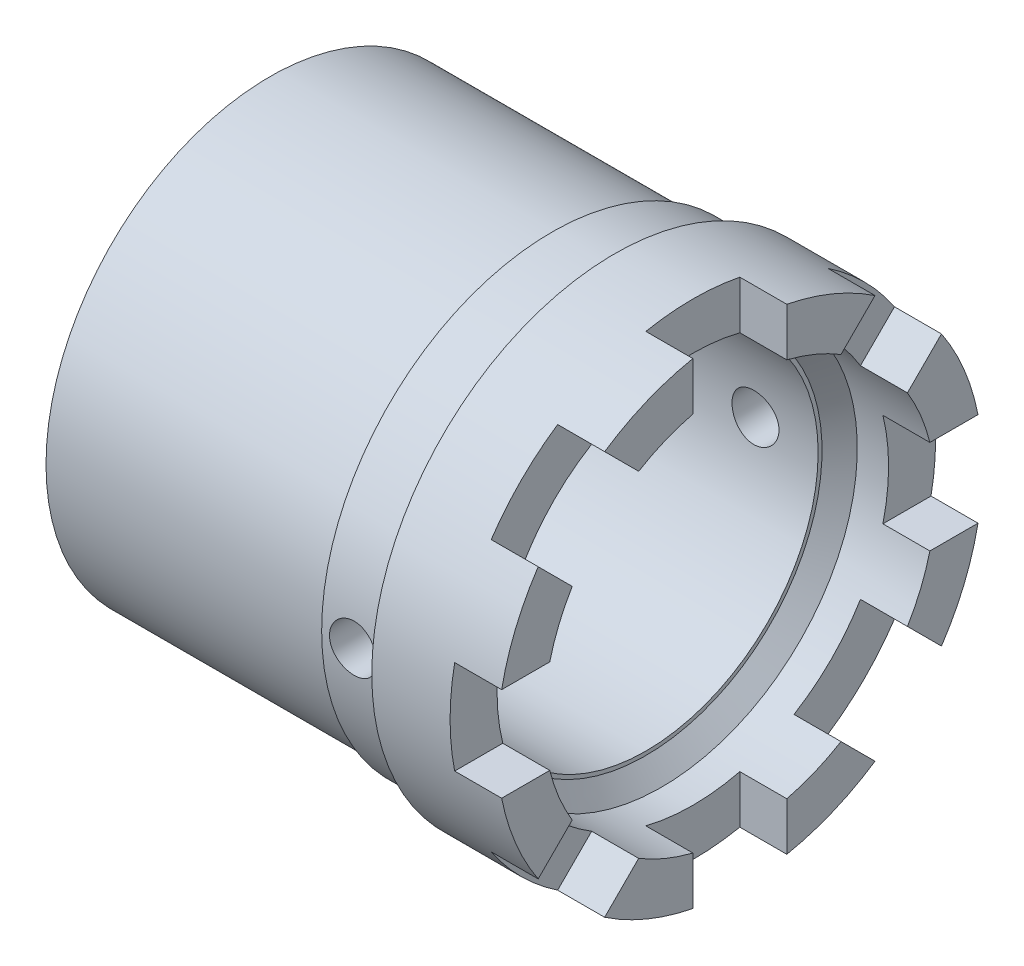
ISO-10303-21;
HEADER;
FILE_DESCRIPTION(('STEP AP214'),'2;1');
FILE_NAME('part.step','',(''),(''),'','','');
FILE_SCHEMA(('AUTOMOTIVE_DESIGN { 1 0 10303 214 1 1 1 1 }'));
ENDSEC;
DATA;
#1=APPLICATION_CONTEXT('core data for automotive mechanical design processes');
#2=APPLICATION_PROTOCOL_DEFINITION('international standard','automotive_design',2000,#1);
#3=PRODUCT_CONTEXT('',#1,'mechanical');
#4=PRODUCT('Part','Part','',(#3));
#5=PRODUCT_RELATED_PRODUCT_CATEGORY('part','',(#4));
#6=PRODUCT_DEFINITION_FORMATION('','',#4);
#7=PRODUCT_DEFINITION_CONTEXT('part definition',#1,'design');
#8=PRODUCT_DEFINITION('design','',#6,#7);
#9=PRODUCT_DEFINITION_SHAPE('','',#8);
#10=(LENGTH_UNIT() NAMED_UNIT(*) SI_UNIT(.MILLI.,.METRE.));
#11=(NAMED_UNIT(*) PLANE_ANGLE_UNIT() SI_UNIT($,.RADIAN.));
#12=(NAMED_UNIT(*) SI_UNIT($,.STERADIAN.) SOLID_ANGLE_UNIT());
#13=UNCERTAINTY_MEASURE_WITH_UNIT(LENGTH_MEASURE(1.E-05),#10,'distance_accuracy_value','');
#14=(GEOMETRIC_REPRESENTATION_CONTEXT(3) GLOBAL_UNCERTAINTY_ASSIGNED_CONTEXT((#13)) GLOBAL_UNIT_ASSIGNED_CONTEXT((#10,
#11,#12)) REPRESENTATION_CONTEXT('',''));
#15=CARTESIAN_POINT('',(0.,0.,0.));
#16=DIRECTION('',(0.,0.,1.));
#17=DIRECTION('',(1.,0.,0.));
#18=AXIS2_PLACEMENT_3D('',#15,#16,#17);
#19=CARTESIAN_POINT('',(6.,12.5,0.));
#20=DIRECTION('',(-1.,0.,0.));
#21=DIRECTION('',(0.,0.,1.));
#22=AXIS2_PLACEMENT_3D('',#19,#20,#21);
#23=PLANE('',#22);
#24=DIRECTION('',(0.,0.707106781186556,-0.707106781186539));
#25=VECTOR('',#24,1.);
#26=CARTESIAN_POINT('',(6.,9.19238815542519,-4.94974746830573));
#27=LINE('',#26,#25);
#28=CARTESIAN_POINT('',(6.,10.701821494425,-6.45918080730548));
#29=VERTEX_POINT('',#28);
#30=CARTESIAN_POINT('',(6.,12.874226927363,-8.63158624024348));
#31=VERTEX_POINT('',#30);
#32=EDGE_CURVE('E248',#29,#31,#27,.T.);
#33=ORIENTED_EDGE('',*,*,#32,.T.);
#34=CARTESIAN_POINT('',(6.,0.,0.));
#35=DIRECTION('',(-1.,0.,0.));
#36=DIRECTION('',(0.,0.,1.));
#37=AXIS2_PLACEMENT_3D('',#34,#35,#36);
#38=CIRCLE('',#37,15.5);
#39=CARTESIAN_POINT('',(6.,15.2069063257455,-3.));
#40=VERTEX_POINT('',#39);
#41=EDGE_CURVE('E575',#40,#31,#38,.T.);
#42=ORIENTED_EDGE('',*,*,#41,.F.);
#43=DIRECTION('',(0.,-1.,0.));
#44=VECTOR('',#43,1.);
#45=CARTESIAN_POINT('',(6.,17.,-3.));
#46=LINE('',#45,#44);
#47=CARTESIAN_POINT('',(6.,12.1346610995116,-3.));
#48=VERTEX_POINT('',#47);
#49=EDGE_CURVE('E269',#40,#48,#46,.T.);
#50=ORIENTED_EDGE('',*,*,#49,.T.);
#51=CARTESIAN_POINT('',(6.,0.,0.));
#52=DIRECTION('',(-1.,0.,0.));
#53=DIRECTION('',(0.,0.,1.));
#54=AXIS2_PLACEMENT_3D('',#51,#52,#53);
#55=CIRCLE('',#54,12.5);
#56=EDGE_CURVE('E265',#48,#29,#55,.T.);
#57=ORIENTED_EDGE('',*,*,#56,.T.);
#58=EDGE_LOOP('',(#33,#42,#50,#57));
#59=FACE_BOUND('',#58,.T.);
#60=ADVANCED_FACE('F31',(#59),#23,.F.);
#61=DIRECTION('',(0.,-0.707106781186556,0.707106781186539));
#62=VECTOR('',#61,1.);
#63=CARTESIAN_POINT('',(6.,9.89949493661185,-14.1421356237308));
#64=LINE('',#63,#62);
#65=CARTESIAN_POINT('',(6.,8.63158624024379,-12.8742269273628));
#66=VERTEX_POINT('',#65);
#67=CARTESIAN_POINT('',(6.,6.45918080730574,-10.7018214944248));
#68=VERTEX_POINT('',#67);
#69=EDGE_CURVE('E259',#66,#68,#64,.T.);
#70=ORIENTED_EDGE('',*,*,#69,.T.);
#71=CARTESIAN_POINT('',(6.,3.00000000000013,-12.1346610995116));
#72=VERTEX_POINT('',#71);
#73=EDGE_CURVE('E271',#68,#72,#55,.T.);
#74=ORIENTED_EDGE('',*,*,#73,.T.);
#75=DIRECTION('',(0.,0.,-1.));
#76=VECTOR('',#75,1.);
#77=CARTESIAN_POINT('',(6.,3.00000000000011,-9.99999999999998));
#78=LINE('',#77,#76);
#79=CARTESIAN_POINT('',(6.,3.00000000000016,-15.2069063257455));
#80=VERTEX_POINT('',#79);
#81=EDGE_CURVE('E414',#72,#80,#78,.T.);
#82=ORIENTED_EDGE('',*,*,#81,.T.);
#83=EDGE_CURVE('E564',#66,#80,#38,.T.);
#84=ORIENTED_EDGE('',*,*,#83,.F.);
#85=EDGE_LOOP('',(#70,#74,#82,#84));
#86=FACE_BOUND('',#85,.T.);
#87=ADVANCED_FACE('F482',(#86),#23,.F.);
#88=CARTESIAN_POINT('',(0.,0.,0.));
#89=DIRECTION('',(-1.,0.,0.));
#90=DIRECTION('',(0.,0.,1.));
#91=AXIS2_PLACEMENT_3D('',#88,#89,#90);
#92=CYLINDRICAL_SURFACE('',#91,15.5);
#93=CARTESIAN_POINT('',(-2.,0.,0.));
#94=DIRECTION('',(-1.,0.,0.));
#95=DIRECTION('',(0.,0.,1.));
#96=AXIS2_PLACEMENT_3D('',#93,#94,#95);
#97=CIRCLE('',#96,15.5);
#98=CARTESIAN_POINT('',(-2.,0.,15.5));
#99=VERTEX_POINT('',#98);
#100=EDGE_CURVE('E580',#99,#99,#97,.T.);
#101=ORIENTED_EDGE('',*,*,#100,.F.);
#102=EDGE_LOOP('',(#101));
#103=FACE_BOUND('',#102,.T.);
#104=DIRECTION('',(-1.,0.,0.));
#105=VECTOR('',#104,1.);
#106=CARTESIAN_POINT('',(0.,12.874226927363,-8.63158624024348));
#107=LINE('',#106,#105);
#108=CARTESIAN_POINT('',(3.,12.874226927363,-8.63158624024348));
#109=VERTEX_POINT('',#108);
#110=EDGE_CURVE('E254',#109,#31,#107,.F.);
#111=ORIENTED_EDGE('',*,*,#110,.F.);
#112=CARTESIAN_POINT('',(3.,0.,0.));
#113=DIRECTION('',(1.,0.,0.));
#114=DIRECTION('',(0.,0.,-1.));
#115=AXIS2_PLACEMENT_3D('',#112,#113,#114);
#116=CIRCLE('',#115,15.5);
#117=CARTESIAN_POINT('',(3.,8.63158624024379,-12.8742269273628));
#118=VERTEX_POINT('',#117);
#119=EDGE_CURVE('E420',#118,#109,#116,.T.);
#120=ORIENTED_EDGE('',*,*,#119,.F.);
#121=DIRECTION('',(-1.,0.,0.));
#122=VECTOR('',#121,1.);
#123=CARTESIAN_POINT('',(0.,8.63158624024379,-12.8742269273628));
#124=LINE('',#123,#122);
#125=EDGE_CURVE('E418',#66,#118,#124,.T.);
#126=ORIENTED_EDGE('',*,*,#125,.F.);
#127=ORIENTED_EDGE('',*,*,#83,.T.);
#128=DIRECTION('',(-1.,0.,0.));
#129=VECTOR('',#128,1.);
#130=CARTESIAN_POINT('',(0.,3.00000000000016,-15.2069063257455));
#131=LINE('',#130,#129);
#132=CARTESIAN_POINT('',(3.,3.00000000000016,-15.2069063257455));
#133=VERTEX_POINT('',#132);
#134=EDGE_CURVE('E398',#133,#80,#131,.F.);
#135=ORIENTED_EDGE('',*,*,#134,.F.);
#136=CARTESIAN_POINT('',(3.,0.,0.));
#137=DIRECTION('',(1.,0.,0.));
#138=DIRECTION('',(0.,0.,-1.));
#139=AXIS2_PLACEMENT_3D('',#136,#137,#138);
#140=CIRCLE('',#139,15.5);
#141=CARTESIAN_POINT('',(3.,-2.99999999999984,-15.2069063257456));
#142=VERTEX_POINT('',#141);
#143=EDGE_CURVE('E403',#142,#133,#140,.T.);
#144=ORIENTED_EDGE('',*,*,#143,.F.);
#145=DIRECTION('',(-1.,0.,0.));
#146=VECTOR('',#145,1.);
#147=CARTESIAN_POINT('',(0.,-2.99999999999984,-15.2069063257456));
#148=LINE('',#147,#146);
#149=CARTESIAN_POINT('',(6.,-2.99999999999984,-15.2069063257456));
#150=VERTEX_POINT('',#149);
#151=EDGE_CURVE('E401',#150,#142,#148,.T.);
#152=ORIENTED_EDGE('',*,*,#151,.F.);
#153=CARTESIAN_POINT('',(6.,-8.63158624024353,-12.874226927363));
#154=VERTEX_POINT('',#153);
#155=EDGE_CURVE('E576',#150,#154,#38,.T.);
#156=ORIENTED_EDGE('',*,*,#155,.T.);
#157=DIRECTION('',(-1.,0.,0.));
#158=VECTOR('',#157,1.);
#159=CARTESIAN_POINT('',(0.,-8.63158624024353,-12.874226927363));
#160=LINE('',#159,#158);
#161=CARTESIAN_POINT('',(3.,-8.63158624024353,-12.874226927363));
#162=VERTEX_POINT('',#161);
#163=EDGE_CURVE('E379',#162,#154,#160,.F.);
#164=ORIENTED_EDGE('',*,*,#163,.F.);
#165=CARTESIAN_POINT('',(3.,0.,0.));
#166=DIRECTION('',(1.,0.,0.));
#167=DIRECTION('',(0.,0.,-1.));
#168=AXIS2_PLACEMENT_3D('',#165,#166,#167);
#169=CIRCLE('',#168,15.5);
#170=CARTESIAN_POINT('',(3.,-12.8742269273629,-8.63158624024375));
#171=VERTEX_POINT('',#170);
#172=EDGE_CURVE('E384',#171,#162,#169,.T.);
#173=ORIENTED_EDGE('',*,*,#172,.F.);
#174=DIRECTION('',(-1.,0.,0.));
#175=VECTOR('',#174,1.);
#176=CARTESIAN_POINT('',(0.,-12.8742269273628,-8.63158624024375));
#177=LINE('',#176,#175);
#178=CARTESIAN_POINT('',(6.,-12.8742269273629,-8.63158624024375));
#179=VERTEX_POINT('',#178);
#180=EDGE_CURVE('E382',#179,#171,#177,.T.);
#181=ORIENTED_EDGE('',*,*,#180,.F.);
#182=CARTESIAN_POINT('',(6.,-15.2069063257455,-3.00000000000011));
#183=VERTEX_POINT('',#182);
#184=EDGE_CURVE('E578',#179,#183,#38,.T.);
#185=ORIENTED_EDGE('',*,*,#184,.T.);
#186=DIRECTION('',(-1.,0.,0.));
#187=VECTOR('',#186,1.);
#188=CARTESIAN_POINT('',(0.,-15.2069063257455,-3.00000000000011));
#189=LINE('',#188,#187);
#190=CARTESIAN_POINT('',(3.,-15.2069063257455,-3.00000000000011));
#191=VERTEX_POINT('',#190);
#192=EDGE_CURVE('E360',#191,#183,#189,.F.);
#193=ORIENTED_EDGE('',*,*,#192,.F.);
#194=CARTESIAN_POINT('',(3.,0.,0.));
#195=DIRECTION('',(1.,0.,0.));
#196=DIRECTION('',(0.,0.,-1.));
#197=AXIS2_PLACEMENT_3D('',#194,#195,#196);
#198=CIRCLE('',#197,15.5);
#199=CARTESIAN_POINT('',(3.,-15.2069063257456,2.9999999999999));
#200=VERTEX_POINT('',#199);
#201=EDGE_CURVE('E365',#200,#191,#198,.T.);
#202=ORIENTED_EDGE('',*,*,#201,.F.);
#203=DIRECTION('',(-1.,0.,0.));
#204=VECTOR('',#203,1.);
#205=CARTESIAN_POINT('',(0.,-15.2069063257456,2.9999999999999));
#206=LINE('',#205,#204);
#207=CARTESIAN_POINT('',(6.,-15.2069063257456,2.9999999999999));
#208=VERTEX_POINT('',#207);
#209=EDGE_CURVE('E363',#208,#200,#206,.T.);
#210=ORIENTED_EDGE('',*,*,#209,.F.);
#211=CARTESIAN_POINT('',(6.,-12.874226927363,8.63158624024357));
#212=VERTEX_POINT('',#211);
#213=EDGE_CURVE('E930',#208,#212,#38,.T.);
#214=ORIENTED_EDGE('',*,*,#213,.T.);
#215=DIRECTION('',(-1.,0.,0.));
#216=VECTOR('',#215,1.);
#217=CARTESIAN_POINT('',(0.,-12.874226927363,8.63158624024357));
#218=LINE('',#217,#216);
#219=CARTESIAN_POINT('',(3.,-12.874226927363,8.63158624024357));
#220=VERTEX_POINT('',#219);
#221=EDGE_CURVE('E341',#220,#212,#218,.F.);
#222=ORIENTED_EDGE('',*,*,#221,.F.);
#223=CARTESIAN_POINT('',(3.,0.,0.));
#224=DIRECTION('',(1.,0.,0.));
#225=DIRECTION('',(0.,0.,-1.));
#226=AXIS2_PLACEMENT_3D('',#223,#224,#225);
#227=CIRCLE('',#226,15.5);
#228=CARTESIAN_POINT('',(3.,-8.6315862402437,12.8742269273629));
#229=VERTEX_POINT('',#228);
#230=EDGE_CURVE('E346',#229,#220,#227,.T.);
#231=ORIENTED_EDGE('',*,*,#230,.F.);
#232=DIRECTION('',(-1.,0.,0.));
#233=VECTOR('',#232,1.);
#234=CARTESIAN_POINT('',(0.,-8.6315862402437,12.8742269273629));
#235=LINE('',#234,#233);
#236=CARTESIAN_POINT('',(6.,-8.6315862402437,12.8742269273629));
#237=VERTEX_POINT('',#236);
#238=EDGE_CURVE('E344',#237,#229,#235,.T.);
#239=ORIENTED_EDGE('',*,*,#238,.F.);
#240=CARTESIAN_POINT('',(6.,-3.00000000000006,15.2069063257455));
#241=VERTEX_POINT('',#240);
#242=EDGE_CURVE('E929',#237,#241,#38,.T.);
#243=ORIENTED_EDGE('',*,*,#242,.T.);
#244=DIRECTION('',(-1.,0.,0.));
#245=VECTOR('',#244,1.);
#246=CARTESIAN_POINT('',(0.,-3.00000000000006,15.2069063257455));
#247=LINE('',#246,#245);
#248=CARTESIAN_POINT('',(3.,-3.00000000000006,15.2069063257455));
#249=VERTEX_POINT('',#248);
#250=EDGE_CURVE('E322',#249,#241,#247,.F.);
#251=ORIENTED_EDGE('',*,*,#250,.F.);
#252=CARTESIAN_POINT('',(3.,0.,0.));
#253=DIRECTION('',(1.,0.,0.));
#254=DIRECTION('',(0.,0.,-1.));
#255=AXIS2_PLACEMENT_3D('',#252,#253,#254);
#256=CIRCLE('',#255,15.5);
#257=CARTESIAN_POINT('',(3.,2.99999999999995,15.2069063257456));
#258=VERTEX_POINT('',#257);
#259=EDGE_CURVE('E327',#258,#249,#256,.T.);
#260=ORIENTED_EDGE('',*,*,#259,.F.);
#261=DIRECTION('',(-1.,0.,0.));
#262=VECTOR('',#261,1.);
#263=CARTESIAN_POINT('',(0.,2.99999999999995,15.2069063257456));
#264=LINE('',#263,#262);
#265=CARTESIAN_POINT('',(6.,2.99999999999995,15.2069063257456));
#266=VERTEX_POINT('',#265);
#267=EDGE_CURVE('E325',#266,#258,#264,.T.);
#268=ORIENTED_EDGE('',*,*,#267,.F.);
#269=CARTESIAN_POINT('',(6.,8.63158624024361,12.8742269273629));
#270=VERTEX_POINT('',#269);
#271=EDGE_CURVE('E927',#266,#270,#38,.T.);
#272=ORIENTED_EDGE('',*,*,#271,.T.);
#273=DIRECTION('',(-1.,0.,0.));
#274=VECTOR('',#273,1.);
#275=CARTESIAN_POINT('',(0.,8.63158624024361,12.8742269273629));
#276=LINE('',#275,#274);
#277=CARTESIAN_POINT('',(3.,8.63158624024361,12.8742269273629));
#278=VERTEX_POINT('',#277);
#279=EDGE_CURVE('E304',#278,#270,#276,.F.);
#280=ORIENTED_EDGE('',*,*,#279,.F.);
#281=CARTESIAN_POINT('',(3.,0.,0.));
#282=DIRECTION('',(1.,0.,0.));
#283=DIRECTION('',(0.,0.,-1.));
#284=AXIS2_PLACEMENT_3D('',#281,#282,#283);
#285=CIRCLE('',#284,15.5);
#286=CARTESIAN_POINT('',(3.,12.8742269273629,8.63158624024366));
#287=VERTEX_POINT('',#286);
#288=EDGE_CURVE('E309',#287,#278,#285,.T.);
#289=ORIENTED_EDGE('',*,*,#288,.F.);
#290=DIRECTION('',(-1.,0.,0.));
#291=VECTOR('',#290,1.);
#292=CARTESIAN_POINT('',(0.,12.8742269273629,8.63158624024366));
#293=LINE('',#292,#291);
#294=CARTESIAN_POINT('',(6.,12.8742269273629,8.63158624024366));
#295=VERTEX_POINT('',#294);
#296=EDGE_CURVE('E307',#295,#287,#293,.T.);
#297=ORIENTED_EDGE('',*,*,#296,.F.);
#298=CARTESIAN_POINT('',(6.,15.2069063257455,3.));
#299=VERTEX_POINT('',#298);
#300=EDGE_CURVE('E500',#295,#299,#38,.T.);
#301=ORIENTED_EDGE('',*,*,#300,.T.);
#302=DIRECTION('',(-1.,0.,0.));
#303=VECTOR('',#302,1.);
#304=CARTESIAN_POINT('',(0.,15.2069063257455,3.));
#305=LINE('',#304,#303);
#306=CARTESIAN_POINT('',(3.,15.2069063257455,3.));
#307=VERTEX_POINT('',#306);
#308=EDGE_CURVE('E280',#307,#299,#305,.F.);
#309=ORIENTED_EDGE('',*,*,#308,.F.);
#310=CARTESIAN_POINT('',(3.,0.,0.));
#311=DIRECTION('',(1.,0.,0.));
#312=DIRECTION('',(0.,0.,-1.));
#313=AXIS2_PLACEMENT_3D('',#310,#311,#312);
#314=CIRCLE('',#313,15.5);
#315=CARTESIAN_POINT('',(3.,15.2069063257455,-3.));
#316=VERTEX_POINT('',#315);
#317=EDGE_CURVE('E292',#316,#307,#314,.T.);
#318=ORIENTED_EDGE('',*,*,#317,.F.);
#319=DIRECTION('',(-1.,0.,0.));
#320=VECTOR('',#319,1.);
#321=CARTESIAN_POINT('',(0.,15.2069063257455,-3.));
#322=LINE('',#321,#320);
#323=EDGE_CURVE('E288',#40,#316,#322,.T.);
#324=ORIENTED_EDGE('',*,*,#323,.F.);
#325=ORIENTED_EDGE('',*,*,#41,.T.);
#326=EDGE_LOOP('',(#111,#120,#126,#127,#135,#144,#152,#156,#164,#173,#181,#185,#193,#202,#210,
#214,#222,#231,#239,#243,#251,#260,#268,#272,#280,#289,#297,#301,#309,#318,#324,#325));
#327=FACE_BOUND('',#326,.T.);
#328=ADVANCED_FACE('F487',(#103,#327),#92,.T.);
#329=CARTESIAN_POINT('',(0.,0.,0.));
#330=DIRECTION('',(-1.,0.,0.));
#331=DIRECTION('',(0.,0.,1.));
#332=AXIS2_PLACEMENT_3D('',#329,#330,#331);
#333=CYLINDRICAL_SURFACE('',#332,12.5);
#334=CARTESIAN_POINT('',(1.,0.,0.));
#335=DIRECTION('',(-1.,0.,0.));
#336=DIRECTION('',(0.,0.,1.));
#337=AXIS2_PLACEMENT_3D('',#334,#335,#336);
#338=CIRCLE('',#337,12.5);
#339=CARTESIAN_POINT('',(1.,0.,12.5));
#340=VERTEX_POINT('',#339);
#341=EDGE_CURVE('E270',#340,#340,#338,.T.);
#342=ORIENTED_EDGE('',*,*,#341,.T.);
#343=EDGE_LOOP('',(#342));
#344=FACE_BOUND('',#343,.T.);
#345=DIRECTION('',(-1.,0.,0.));
#346=VECTOR('',#345,1.);
#347=CARTESIAN_POINT('',(0.,10.701821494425,-6.45918080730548));
#348=LINE('',#347,#346);
#349=CARTESIAN_POINT('',(3.,10.701821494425,-6.45918080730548));
#350=VERTEX_POINT('',#349);
#351=EDGE_CURVE('E11',#29,#350,#348,.T.);
#352=ORIENTED_EDGE('',*,*,#351,.F.);
#353=ORIENTED_EDGE('',*,*,#56,.F.);
#354=DIRECTION('',(-1.,0.,0.));
#355=VECTOR('',#354,1.);
#356=CARTESIAN_POINT('',(0.,12.1346610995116,-3.));
#357=LINE('',#356,#355);
#358=CARTESIAN_POINT('',(3.,12.1346610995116,-3.));
#359=VERTEX_POINT('',#358);
#360=EDGE_CURVE('E512',#359,#48,#357,.F.);
#361=ORIENTED_EDGE('',*,*,#360,.F.);
#362=CARTESIAN_POINT('',(3.,0.,0.));
#363=DIRECTION('',(1.,0.,0.));
#364=DIRECTION('',(0.,0.,-1.));
#365=AXIS2_PLACEMENT_3D('',#362,#363,#364);
#366=CIRCLE('',#365,12.5);
#367=CARTESIAN_POINT('',(3.,12.1346610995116,3.));
#368=VERTEX_POINT('',#367);
#369=EDGE_CURVE('E510',#368,#359,#366,.F.);
#370=ORIENTED_EDGE('',*,*,#369,.F.);
#371=DIRECTION('',(-1.,0.,0.));
#372=VECTOR('',#371,1.);
#373=CARTESIAN_POINT('',(0.,12.1346610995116,3.));
#374=LINE('',#373,#372);
#375=CARTESIAN_POINT('',(6.,12.1346610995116,3.));
#376=VERTEX_POINT('',#375);
#377=EDGE_CURVE('E509',#376,#368,#374,.T.);
#378=ORIENTED_EDGE('',*,*,#377,.F.);
#379=CARTESIAN_POINT('',(6.,10.7018214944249,6.45918080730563));
#380=VERTEX_POINT('',#379);
#381=EDGE_CURVE('E273',#380,#376,#55,.T.);
#382=ORIENTED_EDGE('',*,*,#381,.F.);
#383=DIRECTION('',(-1.,0.,0.));
#384=VECTOR('',#383,1.);
#385=CARTESIAN_POINT('',(0.,10.7018214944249,6.45918080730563));
#386=LINE('',#385,#384);
#387=CARTESIAN_POINT('',(3.,10.7018214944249,6.45918080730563));
#388=VERTEX_POINT('',#387);
#389=EDGE_CURVE('E506',#388,#380,#386,.F.);
#390=ORIENTED_EDGE('',*,*,#389,.F.);
#391=CARTESIAN_POINT('',(3.,0.,0.));
#392=DIRECTION('',(1.,0.,0.));
#393=DIRECTION('',(0.,0.,-1.));
#394=AXIS2_PLACEMENT_3D('',#391,#392,#393);
#395=CIRCLE('',#394,12.5);
#396=CARTESIAN_POINT('',(3.,6.45918080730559,10.7018214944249));
#397=VERTEX_POINT('',#396);
#398=EDGE_CURVE('E511',#397,#388,#395,.F.);
#399=ORIENTED_EDGE('',*,*,#398,.F.);
#400=DIRECTION('',(-1.,0.,0.));
#401=VECTOR('',#400,1.);
#402=CARTESIAN_POINT('',(0.,6.45918080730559,10.7018214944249));
#403=LINE('',#402,#401);
#404=CARTESIAN_POINT('',(6.,6.45918080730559,10.7018214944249));
#405=VERTEX_POINT('',#404);
#406=EDGE_CURVE('E519',#405,#397,#403,.T.);
#407=ORIENTED_EDGE('',*,*,#406,.F.);
#408=CARTESIAN_POINT('',(6.,2.99999999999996,12.1346610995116));
#409=VERTEX_POINT('',#408);
#410=EDGE_CURVE('E279',#409,#405,#55,.T.);
#411=ORIENTED_EDGE('',*,*,#410,.F.);
#412=DIRECTION('',(-1.,0.,0.));
#413=VECTOR('',#412,1.);
#414=CARTESIAN_POINT('',(0.,2.99999999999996,12.1346610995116));
#415=LINE('',#414,#413);
#416=CARTESIAN_POINT('',(3.,2.99999999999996,12.1346610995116));
#417=VERTEX_POINT('',#416);
#418=EDGE_CURVE('E524',#417,#409,#415,.F.);
#419=ORIENTED_EDGE('',*,*,#418,.F.);
#420=CARTESIAN_POINT('',(3.,0.,0.));
#421=DIRECTION('',(1.,0.,0.));
#422=DIRECTION('',(0.,0.,-1.));
#423=AXIS2_PLACEMENT_3D('',#420,#421,#422);
#424=CIRCLE('',#423,12.5);
#425=CARTESIAN_POINT('',(3.,-3.00000000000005,12.1346610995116));
#426=VERTEX_POINT('',#425);
#427=EDGE_CURVE('E522',#426,#417,#424,.F.);
#428=ORIENTED_EDGE('',*,*,#427,.F.);
#429=DIRECTION('',(-1.,0.,0.));
#430=VECTOR('',#429,1.);
#431=CARTESIAN_POINT('',(0.,-3.00000000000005,12.1346610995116));
#432=LINE('',#431,#430);
#433=CARTESIAN_POINT('',(6.,-3.00000000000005,12.1346610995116));
#434=VERTEX_POINT('',#433);
#435=EDGE_CURVE('E526',#434,#426,#432,.T.);
#436=ORIENTED_EDGE('',*,*,#435,.F.);
#437=CARTESIAN_POINT('',(6.,-6.45918080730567,10.7018214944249));
#438=VERTEX_POINT('',#437);
#439=EDGE_CURVE('E286',#438,#434,#55,.T.);
#440=ORIENTED_EDGE('',*,*,#439,.F.);
#441=DIRECTION('',(-1.,0.,0.));
#442=VECTOR('',#441,1.);
#443=CARTESIAN_POINT('',(0.,-6.45918080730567,10.7018214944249));
#444=LINE('',#443,#442);
#445=CARTESIAN_POINT('',(3.,-6.45918080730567,10.7018214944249));
#446=VERTEX_POINT('',#445);
#447=EDGE_CURVE('E531',#446,#438,#444,.F.);
#448=ORIENTED_EDGE('',*,*,#447,.F.);
#449=CARTESIAN_POINT('',(3.,0.,0.));
#450=DIRECTION('',(1.,0.,0.));
#451=DIRECTION('',(0.,0.,-1.));
#452=AXIS2_PLACEMENT_3D('',#449,#450,#451);
#453=CIRCLE('',#452,12.5);
#454=CARTESIAN_POINT('',(3.,-10.7018214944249,6.45918080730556));
#455=VERTEX_POINT('',#454);
#456=EDGE_CURVE('E529',#455,#446,#453,.F.);
#457=ORIENTED_EDGE('',*,*,#456,.F.);
#458=DIRECTION('',(-1.,0.,0.));
#459=VECTOR('',#458,1.);
#460=CARTESIAN_POINT('',(0.,-10.7018214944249,6.45918080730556));
#461=LINE('',#460,#459);
#462=CARTESIAN_POINT('',(6.,-10.7018214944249,6.45918080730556));
#463=VERTEX_POINT('',#462);
#464=EDGE_CURVE('E533',#463,#455,#461,.T.);
#465=ORIENTED_EDGE('',*,*,#464,.F.);
#466=CARTESIAN_POINT('',(6.,-12.1346610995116,2.99999999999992));
#467=VERTEX_POINT('',#466);
#468=EDGE_CURVE('E905',#467,#463,#55,.T.);
#469=ORIENTED_EDGE('',*,*,#468,.F.);
#470=DIRECTION('',(-1.,0.,0.));
#471=VECTOR('',#470,1.);
#472=CARTESIAN_POINT('',(0.,-12.1346610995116,2.99999999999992));
#473=LINE('',#472,#471);
#474=CARTESIAN_POINT('',(3.,-12.1346610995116,2.99999999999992));
#475=VERTEX_POINT('',#474);
#476=EDGE_CURVE('E538',#475,#467,#473,.F.);
#477=ORIENTED_EDGE('',*,*,#476,.F.);
#478=CARTESIAN_POINT('',(3.,0.,0.));
#479=DIRECTION('',(1.,0.,0.));
#480=DIRECTION('',(0.,0.,-1.));
#481=AXIS2_PLACEMENT_3D('',#478,#479,#480);
#482=CIRCLE('',#481,12.5);
#483=CARTESIAN_POINT('',(3.,-12.1346610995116,-3.00000000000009));
#484=VERTEX_POINT('',#483);
#485=EDGE_CURVE('E536',#484,#475,#482,.F.);
#486=ORIENTED_EDGE('',*,*,#485,.F.);
#487=DIRECTION('',(-1.,0.,0.));
#488=VECTOR('',#487,1.);
#489=CARTESIAN_POINT('',(0.,-12.1346610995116,-3.00000000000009));
#490=LINE('',#489,#488);
#491=CARTESIAN_POINT('',(6.,-12.1346610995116,-3.00000000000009));
#492=VERTEX_POINT('',#491);
#493=EDGE_CURVE('E540',#492,#484,#490,.T.);
#494=ORIENTED_EDGE('',*,*,#493,.F.);
#495=CARTESIAN_POINT('',(6.,-10.7018214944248,-6.4591808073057));
#496=VERTEX_POINT('',#495);
#497=EDGE_CURVE('E904',#496,#492,#55,.T.);
#498=ORIENTED_EDGE('',*,*,#497,.F.);
#499=DIRECTION('',(-1.,0.,0.));
#500=VECTOR('',#499,1.);
#501=CARTESIAN_POINT('',(0.,-10.7018214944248,-6.45918080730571));
#502=LINE('',#501,#500);
#503=CARTESIAN_POINT('',(3.,-10.7018214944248,-6.4591808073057));
#504=VERTEX_POINT('',#503);
#505=EDGE_CURVE('E545',#504,#496,#502,.F.);
#506=ORIENTED_EDGE('',*,*,#505,.F.);
#507=CARTESIAN_POINT('',(3.,0.,0.));
#508=DIRECTION('',(1.,0.,0.));
#509=DIRECTION('',(0.,0.,-1.));
#510=AXIS2_PLACEMENT_3D('',#507,#508,#509);
#511=CIRCLE('',#510,12.5);
#512=CARTESIAN_POINT('',(3.,-6.45918080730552,-10.701821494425));
#513=VERTEX_POINT('',#512);
#514=EDGE_CURVE('E543',#513,#504,#511,.F.);
#515=ORIENTED_EDGE('',*,*,#514,.F.);
#516=DIRECTION('',(-1.,0.,0.));
#517=VECTOR('',#516,1.);
#518=CARTESIAN_POINT('',(0.,-6.45918080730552,-10.701821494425));
#519=LINE('',#518,#517);
#520=CARTESIAN_POINT('',(6.,-6.45918080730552,-10.701821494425));
#521=VERTEX_POINT('',#520);
#522=EDGE_CURVE('E547',#521,#513,#519,.T.);
#523=ORIENTED_EDGE('',*,*,#522,.F.);
#524=CARTESIAN_POINT('',(6.,-2.99999999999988,-12.1346610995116));
#525=VERTEX_POINT('',#524);
#526=EDGE_CURVE('E277',#525,#521,#55,.T.);
#527=ORIENTED_EDGE('',*,*,#526,.F.);
#528=DIRECTION('',(-1.,0.,0.));
#529=VECTOR('',#528,1.);
#530=CARTESIAN_POINT('',(0.,-2.99999999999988,-12.1346610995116));
#531=LINE('',#530,#529);
#532=CARTESIAN_POINT('',(3.,-2.99999999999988,-12.1346610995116));
#533=VERTEX_POINT('',#532);
#534=EDGE_CURVE('E552',#533,#525,#531,.F.);
#535=ORIENTED_EDGE('',*,*,#534,.F.);
#536=CARTESIAN_POINT('',(3.,0.,0.));
#537=DIRECTION('',(1.,0.,0.));
#538=DIRECTION('',(0.,0.,-1.));
#539=AXIS2_PLACEMENT_3D('',#536,#537,#538);
#540=CIRCLE('',#539,12.5);
#541=CARTESIAN_POINT('',(3.,3.00000000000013,-12.1346610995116));
#542=VERTEX_POINT('',#541);
#543=EDGE_CURVE('E550',#542,#533,#540,.F.);
#544=ORIENTED_EDGE('',*,*,#543,.F.);
#545=DIRECTION('',(-1.,0.,0.));
#546=VECTOR('',#545,1.);
#547=CARTESIAN_POINT('',(0.,3.00000000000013,-12.1346610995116));
#548=LINE('',#547,#546);
#549=EDGE_CURVE('E554',#72,#542,#548,.T.);
#550=ORIENTED_EDGE('',*,*,#549,.F.);
#551=ORIENTED_EDGE('',*,*,#73,.F.);
#552=DIRECTION('',(-1.,0.,0.));
#553=VECTOR('',#552,1.);
#554=CARTESIAN_POINT('',(0.,6.45918080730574,-10.7018214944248));
#555=LINE('',#554,#553);
#556=CARTESIAN_POINT('',(3.,6.45918080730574,-10.7018214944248));
#557=VERTEX_POINT('',#556);
#558=EDGE_CURVE('E43',#557,#68,#555,.F.);
#559=ORIENTED_EDGE('',*,*,#558,.F.);
#560=CARTESIAN_POINT('',(3.,0.,0.));
#561=DIRECTION('',(1.,0.,0.));
#562=DIRECTION('',(0.,0.,-1.));
#563=AXIS2_PLACEMENT_3D('',#560,#561,#562);
#564=CIRCLE('',#563,12.5);
#565=EDGE_CURVE('E267',#350,#557,#564,.F.);
#566=ORIENTED_EDGE('',*,*,#565,.F.);
#567=EDGE_LOOP('',(#352,#353,#361,#370,#378,#382,#390,#399,#407,#411,#419,#428,#436,#440,#448,
#457,#465,#469,#477,#486,#494,#498,#506,#515,#523,#527,#535,#544,#550,#551,#559,#566));
#568=FACE_BOUND('',#567,.T.);
#569=ADVANCED_FACE('F263',(#344,#568),#333,.F.);
#570=DIRECTION('',(0.,0.,1.));
#571=VECTOR('',#570,1.);
#572=CARTESIAN_POINT('',(6.,-2.99999999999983,-17.));
#573=LINE('',#572,#571);
#574=EDGE_CURVE('E411',#150,#525,#573,.T.);
#575=ORIENTED_EDGE('',*,*,#574,.T.);
#576=ORIENTED_EDGE('',*,*,#526,.T.);
#577=DIRECTION('',(0.,-0.707106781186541,-0.707106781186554));
#578=VECTOR('',#577,1.);
#579=CARTESIAN_POINT('',(6.,-4.94974746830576,-9.19238815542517));
#580=LINE('',#579,#578);
#581=EDGE_CURVE('E395',#521,#154,#580,.T.);
#582=ORIENTED_EDGE('',*,*,#581,.T.);
#583=ORIENTED_EDGE('',*,*,#155,.F.);
#584=EDGE_LOOP('',(#575,#576,#582,#583));
#585=FACE_BOUND('',#584,.T.);
#586=ADVANCED_FACE('F489',(#585),#23,.F.);
#587=DIRECTION('',(0.,0.707106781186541,0.707106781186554));
#588=VECTOR('',#587,1.);
#589=CARTESIAN_POINT('',(6.,-14.1421356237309,-9.8994949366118));
#590=LINE('',#589,#588);
#591=EDGE_CURVE('E392',#179,#496,#590,.T.);
#592=ORIENTED_EDGE('',*,*,#591,.T.);
#593=ORIENTED_EDGE('',*,*,#497,.T.);
#594=DIRECTION('',(0.,-1.,0.));
#595=VECTOR('',#594,1.);
#596=CARTESIAN_POINT('',(6.,-9.99999999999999,-3.00000000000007));
#597=LINE('',#596,#595);
#598=EDGE_CURVE('E376',#492,#183,#597,.T.);
#599=ORIENTED_EDGE('',*,*,#598,.T.);
#600=ORIENTED_EDGE('',*,*,#184,.F.);
#601=EDGE_LOOP('',(#592,#593,#599,#600));
#602=FACE_BOUND('',#601,.T.);
#603=ADVANCED_FACE('F608',(#602),#23,.F.);
#604=DIRECTION('',(0.,1.,0.));
#605=VECTOR('',#604,1.);
#606=CARTESIAN_POINT('',(6.,-17.,2.99999999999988));
#607=LINE('',#606,#605);
#608=EDGE_CURVE('E373',#208,#467,#607,.T.);
#609=ORIENTED_EDGE('',*,*,#608,.T.);
#610=ORIENTED_EDGE('',*,*,#468,.T.);
#611=DIRECTION('',(0.,-0.707106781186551,0.707106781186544));
#612=VECTOR('',#611,1.);
#613=CARTESIAN_POINT('',(6.,-9.19238815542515,4.94974746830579));
#614=LINE('',#613,#612);
#615=EDGE_CURVE('E357',#463,#212,#614,.T.);
#616=ORIENTED_EDGE('',*,*,#615,.T.);
#617=ORIENTED_EDGE('',*,*,#213,.F.);
#618=EDGE_LOOP('',(#609,#610,#616,#617));
#619=FACE_BOUND('',#618,.T.);
#620=ADVANCED_FACE('F945',(#619),#23,.F.);
#621=DIRECTION('',(0.,0.707106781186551,-0.707106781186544));
#622=VECTOR('',#621,1.);
#623=CARTESIAN_POINT('',(6.,-9.89949493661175,14.1421356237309));
#624=LINE('',#623,#622);
#625=EDGE_CURVE('E354',#237,#438,#624,.T.);
#626=ORIENTED_EDGE('',*,*,#625,.T.);
#627=ORIENTED_EDGE('',*,*,#439,.T.);
#628=DIRECTION('',(0.,0.,1.));
#629=VECTOR('',#628,1.);
#630=CARTESIAN_POINT('',(6.,-3.00000000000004,10.));
#631=LINE('',#630,#629);
#632=EDGE_CURVE('E338',#434,#241,#631,.T.);
#633=ORIENTED_EDGE('',*,*,#632,.T.);
#634=ORIENTED_EDGE('',*,*,#242,.F.);
#635=EDGE_LOOP('',(#626,#627,#633,#634));
#636=FACE_BOUND('',#635,.T.);
#637=ADVANCED_FACE('F497',(#636),#23,.F.);
#638=DIRECTION('',(0.,0.,-1.));
#639=VECTOR('',#638,1.);
#640=CARTESIAN_POINT('',(6.,2.99999999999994,17.));
#641=LINE('',#640,#639);
#642=EDGE_CURVE('E335',#266,#409,#641,.T.);
#643=ORIENTED_EDGE('',*,*,#642,.T.);
#644=ORIENTED_EDGE('',*,*,#410,.T.);
#645=DIRECTION('',(0.,0.707106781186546,0.707106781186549));
#646=VECTOR('',#645,1.);
#647=CARTESIAN_POINT('',(6.,4.94974746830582,9.19238815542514));
#648=LINE('',#647,#646);
#649=EDGE_CURVE('E319',#405,#270,#648,.T.);
#650=ORIENTED_EDGE('',*,*,#649,.T.);
#651=ORIENTED_EDGE('',*,*,#271,.F.);
#652=EDGE_LOOP('',(#643,#644,#650,#651));
#653=FACE_BOUND('',#652,.T.);
#654=ADVANCED_FACE('F491',(#653),#23,.F.);
#655=DIRECTION('',(0.,-0.707106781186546,-0.707106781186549));
#656=VECTOR('',#655,1.);
#657=CARTESIAN_POINT('',(6.,14.1421356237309,9.8994949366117));
#658=LINE('',#657,#656);
#659=EDGE_CURVE('E317',#295,#380,#658,.T.);
#660=ORIENTED_EDGE('',*,*,#659,.T.);
#661=ORIENTED_EDGE('',*,*,#381,.T.);
#662=DIRECTION('',(0.,1.,0.));
#663=VECTOR('',#662,1.);
#664=CARTESIAN_POINT('',(6.,10.,3.));
#665=LINE('',#664,#663);
#666=EDGE_CURVE('E302',#376,#299,#665,.T.);
#667=ORIENTED_EDGE('',*,*,#666,.T.);
#668=ORIENTED_EDGE('',*,*,#300,.F.);
#669=EDGE_LOOP('',(#660,#661,#667,#668));
#670=FACE_BOUND('',#669,.T.);
#671=ADVANCED_FACE('F483',(#670),#23,.F.);
#672=CARTESIAN_POINT('',(-2.,0.,0.));
#673=DIRECTION('',(1.,0.,0.));
#674=DIRECTION('',(0.,0.,-1.));
#675=AXIS2_PLACEMENT_3D('',#672,#673,#674);
#676=CONICAL_SURFACE('',#675,15.5,1.01219701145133);
#677=CARTESIAN_POINT('',(-2.5,0.,0.));
#678=DIRECTION('',(-1.,0.,0.));
#679=DIRECTION('',(0.,0.,1.));
#680=AXIS2_PLACEMENT_3D('',#677,#678,#679);
#681=CIRCLE('',#680,14.7);
#682=CARTESIAN_POINT('',(-2.5,0.,14.7));
#683=VERTEX_POINT('',#682);
#684=CARTESIAN_POINT('',(-2.5,0.,-14.7));
#685=VERTEX_POINT('',#684);
#686=EDGE_CURVE('E633',#683,#685,#681,.T.);
#687=ORIENTED_EDGE('',*,*,#686,.F.);
#688=EDGE_CURVE('E632',#685,#683,#681,.T.);
#689=ORIENTED_EDGE('',*,*,#688,.F.);
#690=EDGE_LOOP('',(#687,#689));
#691=FACE_BOUND('',#690,.T.);
#692=ORIENTED_EDGE('',*,*,#100,.T.);
#693=EDGE_LOOP('',(#692));
#694=FACE_BOUND('',#693,.T.);
#695=ADVANCED_FACE('F477',(#691,#694),#676,.T.);
#696=CARTESIAN_POINT('',(0.,0.,0.));
#697=DIRECTION('',(-1.,0.,0.));
#698=DIRECTION('',(0.,0.,1.));
#699=AXIS2_PLACEMENT_3D('',#696,#697,#698);
#700=CYLINDRICAL_SURFACE('',#699,14.7);
#701=CARTESIAN_POINT('',(-6.,0.,0.));
#702=DIRECTION('',(-1.,0.,0.));
#703=DIRECTION('',(0.,0.,1.));
#704=AXIS2_PLACEMENT_3D('',#701,#702,#703);
#705=CIRCLE('',#704,14.7);
#706=CARTESIAN_POINT('',(-6.,0.,14.7));
#707=VERTEX_POINT('',#706);
#708=EDGE_CURVE('E630',#707,#707,#705,.T.);
#709=ORIENTED_EDGE('',*,*,#708,.F.);
#710=EDGE_LOOP('',(#709));
#711=FACE_BOUND('',#710,.T.);
#712=ORIENTED_EDGE('',*,*,#688,.T.);
#713=CARTESIAN_POINT('',(-2.5,0.,14.7));
#714=CARTESIAN_POINT('',(-2.5000036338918,-0.0840212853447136,14.6999990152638));
#715=CARTESIAN_POINT('',(-2.507083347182,-0.168097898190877,14.6992719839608));
#716=CARTESIAN_POINT('',(-2.53521847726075,-0.33391955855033,14.6964416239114));
#717=CARTESIAN_POINT('',(-2.55628923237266,-0.415661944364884,14.6943367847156));
#718=CARTESIAN_POINT('',(-2.61178610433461,-0.57438992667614,14.6889883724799));
#719=CARTESIAN_POINT('',(-2.64620408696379,-0.651378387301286,14.6857454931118));
#720=CARTESIAN_POINT('',(-2.72740247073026,-0.798469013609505,14.6784834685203));
#721=CARTESIAN_POINT('',(-2.77418043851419,-0.868572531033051,14.674464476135));
#722=CARTESIAN_POINT('',(-2.87895859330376,-1.00018204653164,14.6660835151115));
#723=CARTESIAN_POINT('',(-2.93699558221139,-1.06165867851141,14.6617204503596));
#724=CARTESIAN_POINT('',(-3.06256577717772,-1.17401688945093,14.6531521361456));
#725=CARTESIAN_POINT('',(-3.13009942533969,-1.22489797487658,14.6489468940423));
#726=CARTESIAN_POINT('',(-3.27293026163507,-1.3147251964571,14.6411591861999));
#727=CARTESIAN_POINT('',(-3.34824429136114,-1.35364468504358,14.6375781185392));
#728=CARTESIAN_POINT('',(-3.5043812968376,-1.4182737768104,14.6314578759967));
#729=CARTESIAN_POINT('',(-3.5852041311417,-1.44398371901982,14.6289186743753));
#730=CARTESIAN_POINT('',(-3.74976455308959,-1.48137667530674,14.625179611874));
#731=CARTESIAN_POINT('',(-3.83349094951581,-1.49310846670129,14.6239750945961));
#732=CARTESIAN_POINT('',(-4.00173237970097,-1.50236288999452,14.6230273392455));
#733=CARTESIAN_POINT('',(-4.08624739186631,-1.49988590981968,14.623284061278));
#734=CARTESIAN_POINT('',(-4.25333047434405,-1.48083329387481,14.6252255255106));
#735=CARTESIAN_POINT('',(-4.33590469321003,-1.46431095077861,14.6269048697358));
#736=CARTESIAN_POINT('',(-4.49710200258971,-1.41771955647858,14.6314939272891));
#737=CARTESIAN_POINT('',(-4.57572503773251,-1.38765031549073,14.634403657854));
#738=CARTESIAN_POINT('',(-4.72695630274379,-1.31475996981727,14.6411318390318));
#739=CARTESIAN_POINT('',(-4.79955307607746,-1.27191525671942,14.6449519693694));
#740=CARTESIAN_POINT('',(-4.93654568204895,-1.17470712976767,14.6530691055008));
#741=CARTESIAN_POINT('',(-5.00094126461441,-1.12034336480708,14.6573661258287));
#742=CARTESIAN_POINT('',(-5.12001319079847,-1.00134283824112,14.6659769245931));
#743=CARTESIAN_POINT('',(-5.17464355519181,-0.936660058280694,14.6702906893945));
#744=CARTESIAN_POINT('',(-5.27227779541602,-0.799017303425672,14.6784303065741));
#745=CARTESIAN_POINT('',(-5.315281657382,-0.726057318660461,14.6822561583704));
#746=CARTESIAN_POINT('',(-5.38844046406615,-0.573899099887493,14.6889902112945));
#747=CARTESIAN_POINT('',(-5.41859303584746,-0.494699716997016,14.691898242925));
#748=CARTESIAN_POINT('',(-5.46515943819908,-0.33232607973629,14.6964672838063));
#749=CARTESIAN_POINT('',(-5.48157369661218,-0.249151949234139,14.6981283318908));
#750=CARTESIAN_POINT('',(-5.50013910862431,-0.0815879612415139,14.7000112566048));
#751=CARTESIAN_POINT('',(-5.50235370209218,0.00279479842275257,14.7002395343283));
#752=CARTESIAN_POINT('',(-5.49262360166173,0.170730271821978,14.6992483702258));
#753=CARTESIAN_POINT('',(-5.48067910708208,0.254282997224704,14.6980289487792));
#754=CARTESIAN_POINT('',(-5.44302252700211,0.418003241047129,14.6942835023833));
#755=CARTESIAN_POINT('',(-5.41734018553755,0.498177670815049,14.6917603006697));
#756=CARTESIAN_POINT('',(-5.35296753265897,0.653080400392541,14.6856903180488));
#757=CARTESIAN_POINT('',(-5.31427691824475,0.727808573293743,14.6821435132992));
#758=CARTESIAN_POINT('',(-5.22482895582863,0.869984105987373,14.6744070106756));
#759=CARTESIAN_POINT('',(-5.17402997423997,0.937405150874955,14.6702151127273));
#760=CARTESIAN_POINT('',(-5.06186691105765,1.06278611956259,14.6616657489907));
#761=CARTESIAN_POINT('',(-5.0005025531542,1.12074579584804,14.6573082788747));
#762=CARTESIAN_POINT('',(-4.86867364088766,1.22577939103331,14.6488995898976));
#763=CARTESIAN_POINT('',(-4.79817580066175,1.27281164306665,14.6448495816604));
#764=CARTESIAN_POINT('',(-4.65024507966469,1.35436877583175,14.6375328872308));
#765=CARTESIAN_POINT('',(-4.57281229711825,1.3888938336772,14.6342661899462));
#766=CARTESIAN_POINT('',(-4.41335199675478,1.44438695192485,14.6288935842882));
#767=CARTESIAN_POINT('',(-4.33133314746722,1.46537970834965,14.6267855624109));
#768=CARTESIAN_POINT('',(-4.16491208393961,1.49329240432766,14.6239624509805));
#769=CARTESIAN_POINT('',(-4.08050994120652,1.50021276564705,14.6232473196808));
#770=CARTESIAN_POINT('',(-3.91213232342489,1.49977823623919,14.6232918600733));
#771=CARTESIAN_POINT('',(-3.82815667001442,1.49248879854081,14.6240447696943));
#772=CARTESIAN_POINT('',(-3.6626296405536,1.46397892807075,14.6269261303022));
#773=CARTESIAN_POINT('',(-3.58107826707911,1.44275848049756,14.6290545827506));
#774=CARTESIAN_POINT('',(-3.42271584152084,1.38700720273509,14.6344453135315));
#775=CARTESIAN_POINT('',(-3.34590407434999,1.35247838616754,14.6377074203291));
#776=CARTESIAN_POINT('',(-3.19915573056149,1.27109723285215,14.6449982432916));
#777=CARTESIAN_POINT('',(-3.12921912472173,1.22424494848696,14.6490269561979));
#778=CARTESIAN_POINT('',(-2.99787093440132,1.11930118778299,14.6574192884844));
#779=CARTESIAN_POINT('',(-2.93649841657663,1.06116092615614,14.6617843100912));
#780=CARTESIAN_POINT('',(-2.82435231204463,0.9353887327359,14.6703446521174));
#781=CARTESIAN_POINT('',(-2.77358126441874,0.867754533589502,14.6745399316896));
#782=CARTESIAN_POINT('',(-2.68397432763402,0.724720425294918,14.6822995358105));
#783=CARTESIAN_POINT('',(-2.64516992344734,0.649300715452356,14.6858621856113));
#784=CARTESIAN_POINT('',(-2.58082812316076,0.493027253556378,14.6919370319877));
#785=CARTESIAN_POINT('',(-2.55527580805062,0.412179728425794,14.6944504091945));
#786=CARTESIAN_POINT('',(-2.52451644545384,0.275731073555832,14.6975138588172));
#787=CARTESIAN_POINT('',(-2.51533538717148,0.221001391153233,14.6984418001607));
#788=CARTESIAN_POINT('',(-2.50307597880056,0.110855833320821,14.6996851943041));
#789=CARTESIAN_POINT('',(-2.49999760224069,0.0554399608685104,14.7000006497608));
#790=CARTESIAN_POINT('',(-2.5,0.,14.7));
#791=B_SPLINE_CURVE_WITH_KNOTS('',3,(#713,#714,#715,#716,#717,#718,#719,#720,#721,#722,#723,
#724,#725,#726,#727,#728,#729,#730,#731,#732,#733,#734,#735,#736,#737,#738,#739,#740,#741,#742,
#743,#744,#745,#746,#747,#748,#749,#750,#751,#752,#753,#754,#755,#756,#757,#758,#759,#760,#761,
#762,#763,#764,#765,#766,#767,#768,#769,#770,#771,#772,#773,#774,#775,#776,#777,#778,#779,#780,
#781,#782,#783,#784,#785,#786,#787,#788,#789,#790),.UNSPECIFIED.,.T.,.F.,(4,2,2,2,2,2,2,2,2,2,2,
2,2,2,2,2,2,2,2,2,2,2,2,2,2,2,2,2,2,2,2,2,2,2,2,2,2,2,4),(0.,0.251861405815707,
0.503999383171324,0.755983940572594,1.00791892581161,1.26069171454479,1.51347627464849,
1.76681996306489,2.02015714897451,2.2726076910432,2.52505134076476,2.77654139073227,
3.02803496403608,3.27999619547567,3.53196510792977,3.78509083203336,4.03821685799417,
4.29138960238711,4.54455446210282,4.79658746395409,5.0486169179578,5.30010289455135,
5.55159472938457,5.80396409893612,6.05634006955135,6.30966312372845,6.56298259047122,
6.81583843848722,7.0686867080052,7.32037306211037,7.57205968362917,7.82370823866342,
8.07535572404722,8.32811603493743,8.5809368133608,8.83441721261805,9.08761162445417,
9.2537986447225,9.41998494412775),.UNSPECIFIED.);
#792=EDGE_CURVE('E54',#683,#683,#791,.T.);
#793=ORIENTED_EDGE('',*,*,#792,.T.);
#794=ORIENTED_EDGE('',*,*,#686,.T.);
#795=CARTESIAN_POINT('',(-2.5,0.,-14.7));
#796=CARTESIAN_POINT('',(-2.5000036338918,0.0840212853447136,-14.6999990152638));
#797=CARTESIAN_POINT('',(-2.507083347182,0.168097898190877,-14.6992719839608));
#798=CARTESIAN_POINT('',(-2.53521847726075,0.33391955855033,-14.6964416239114));
#799=CARTESIAN_POINT('',(-2.55628923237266,0.415661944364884,-14.6943367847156));
#800=CARTESIAN_POINT('',(-2.61178610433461,0.57438992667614,-14.6889883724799));
#801=CARTESIAN_POINT('',(-2.64620408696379,0.651378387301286,-14.6857454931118));
#802=CARTESIAN_POINT('',(-2.72740247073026,0.798469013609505,-14.6784834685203));
#803=CARTESIAN_POINT('',(-2.77418043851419,0.868572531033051,-14.674464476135));
#804=CARTESIAN_POINT('',(-2.87895859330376,1.00018204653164,-14.6660835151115));
#805=CARTESIAN_POINT('',(-2.93699558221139,1.06165867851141,-14.6617204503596));
#806=CARTESIAN_POINT('',(-3.06256577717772,1.17401688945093,-14.6531521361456));
#807=CARTESIAN_POINT('',(-3.13009942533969,1.22489797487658,-14.6489468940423));
#808=CARTESIAN_POINT('',(-3.27293026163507,1.3147251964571,-14.6411591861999));
#809=CARTESIAN_POINT('',(-3.34824429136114,1.35364468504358,-14.6375781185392));
#810=CARTESIAN_POINT('',(-3.5043812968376,1.4182737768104,-14.6314578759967));
#811=CARTESIAN_POINT('',(-3.5852041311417,1.44398371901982,-14.6289186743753));
#812=CARTESIAN_POINT('',(-3.74976455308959,1.48137667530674,-14.625179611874));
#813=CARTESIAN_POINT('',(-3.83349094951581,1.49310846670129,-14.6239750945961));
#814=CARTESIAN_POINT('',(-4.00173237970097,1.50236288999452,-14.6230273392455));
#815=CARTESIAN_POINT('',(-4.08624739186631,1.49988590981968,-14.623284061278));
#816=CARTESIAN_POINT('',(-4.25333047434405,1.48083329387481,-14.6252255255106));
#817=CARTESIAN_POINT('',(-4.33590469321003,1.46431095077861,-14.6269048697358));
#818=CARTESIAN_POINT('',(-4.49710200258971,1.41771955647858,-14.6314939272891));
#819=CARTESIAN_POINT('',(-4.57572503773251,1.38765031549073,-14.634403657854));
#820=CARTESIAN_POINT('',(-4.72695630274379,1.31475996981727,-14.6411318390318));
#821=CARTESIAN_POINT('',(-4.79955307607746,1.27191525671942,-14.6449519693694));
#822=CARTESIAN_POINT('',(-4.93654568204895,1.17470712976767,-14.6530691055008));
#823=CARTESIAN_POINT('',(-5.00094126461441,1.12034336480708,-14.6573661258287));
#824=CARTESIAN_POINT('',(-5.12001319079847,1.00134283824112,-14.6659769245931));
#825=CARTESIAN_POINT('',(-5.17464355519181,0.936660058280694,-14.6702906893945));
#826=CARTESIAN_POINT('',(-5.27227779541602,0.799017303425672,-14.6784303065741));
#827=CARTESIAN_POINT('',(-5.315281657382,0.726057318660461,-14.6822561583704));
#828=CARTESIAN_POINT('',(-5.38844046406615,0.573899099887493,-14.6889902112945));
#829=CARTESIAN_POINT('',(-5.41859303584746,0.494699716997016,-14.691898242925));
#830=CARTESIAN_POINT('',(-5.46515943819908,0.33232607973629,-14.6964672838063));
#831=CARTESIAN_POINT('',(-5.48157369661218,0.249151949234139,-14.6981283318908));
#832=CARTESIAN_POINT('',(-5.50013910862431,0.0815879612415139,-14.7000112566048));
#833=CARTESIAN_POINT('',(-5.50235370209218,-0.00279479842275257,-14.7002395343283));
#834=CARTESIAN_POINT('',(-5.49262360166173,-0.170730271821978,-14.6992483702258));
#835=CARTESIAN_POINT('',(-5.48067910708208,-0.254282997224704,-14.6980289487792));
#836=CARTESIAN_POINT('',(-5.44302252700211,-0.418003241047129,-14.6942835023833));
#837=CARTESIAN_POINT('',(-5.41734018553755,-0.498177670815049,-14.6917603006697));
#838=CARTESIAN_POINT('',(-5.35296753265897,-0.653080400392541,-14.6856903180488));
#839=CARTESIAN_POINT('',(-5.31427691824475,-0.727808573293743,-14.6821435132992));
#840=CARTESIAN_POINT('',(-5.22482895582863,-0.869984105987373,-14.6744070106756));
#841=CARTESIAN_POINT('',(-5.17402997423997,-0.937405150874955,-14.6702151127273));
#842=CARTESIAN_POINT('',(-5.06186691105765,-1.06278611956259,-14.6616657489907));
#843=CARTESIAN_POINT('',(-5.0005025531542,-1.12074579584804,-14.6573082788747));
#844=CARTESIAN_POINT('',(-4.86867364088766,-1.22577939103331,-14.6488995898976));
#845=CARTESIAN_POINT('',(-4.79817580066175,-1.27281164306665,-14.6448495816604));
#846=CARTESIAN_POINT('',(-4.65024507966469,-1.35436877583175,-14.6375328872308));
#847=CARTESIAN_POINT('',(-4.57281229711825,-1.3888938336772,-14.6342661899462));
#848=CARTESIAN_POINT('',(-4.41335199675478,-1.44438695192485,-14.6288935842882));
#849=CARTESIAN_POINT('',(-4.33133314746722,-1.46537970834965,-14.6267855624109));
#850=CARTESIAN_POINT('',(-4.16491208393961,-1.49329240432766,-14.6239624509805));
#851=CARTESIAN_POINT('',(-4.08050994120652,-1.50021276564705,-14.6232473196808));
#852=CARTESIAN_POINT('',(-3.91213232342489,-1.49977823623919,-14.6232918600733));
#853=CARTESIAN_POINT('',(-3.82815667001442,-1.49248879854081,-14.6240447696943));
#854=CARTESIAN_POINT('',(-3.6626296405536,-1.46397892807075,-14.6269261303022));
#855=CARTESIAN_POINT('',(-3.58107826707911,-1.44275848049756,-14.6290545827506));
#856=CARTESIAN_POINT('',(-3.42271584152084,-1.38700720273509,-14.6344453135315));
#857=CARTESIAN_POINT('',(-3.34590407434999,-1.35247838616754,-14.6377074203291));
#858=CARTESIAN_POINT('',(-3.19915573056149,-1.27109723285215,-14.6449982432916));
#859=CARTESIAN_POINT('',(-3.12921912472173,-1.22424494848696,-14.6490269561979));
#860=CARTESIAN_POINT('',(-2.99787093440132,-1.11930118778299,-14.6574192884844));
#861=CARTESIAN_POINT('',(-2.93649841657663,-1.06116092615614,-14.6617843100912));
#862=CARTESIAN_POINT('',(-2.82435231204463,-0.9353887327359,-14.6703446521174));
#863=CARTESIAN_POINT('',(-2.77358126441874,-0.867754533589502,-14.6745399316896));
#864=CARTESIAN_POINT('',(-2.68397432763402,-0.724720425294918,-14.6822995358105));
#865=CARTESIAN_POINT('',(-2.64516992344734,-0.649300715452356,-14.6858621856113));
#866=CARTESIAN_POINT('',(-2.58082812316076,-0.493027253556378,-14.6919370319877));
#867=CARTESIAN_POINT('',(-2.55527580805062,-0.412179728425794,-14.6944504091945));
#868=CARTESIAN_POINT('',(-2.52451644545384,-0.275731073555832,-14.6975138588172));
#869=CARTESIAN_POINT('',(-2.51533538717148,-0.221001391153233,-14.6984418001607));
#870=CARTESIAN_POINT('',(-2.50307597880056,-0.110855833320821,-14.6996851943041));
#871=CARTESIAN_POINT('',(-2.49999760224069,-0.0554399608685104,-14.7000006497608));
#872=CARTESIAN_POINT('',(-2.5,0.,-14.7));
#873=B_SPLINE_CURVE_WITH_KNOTS('',3,(#795,#796,#797,#798,#799,#800,#801,#802,#803,#804,#805,
#806,#807,#808,#809,#810,#811,#812,#813,#814,#815,#816,#817,#818,#819,#820,#821,#822,#823,#824,
#825,#826,#827,#828,#829,#830,#831,#832,#833,#834,#835,#836,#837,#838,#839,#840,#841,#842,#843,
#844,#845,#846,#847,#848,#849,#850,#851,#852,#853,#854,#855,#856,#857,#858,#859,#860,#861,#862,
#863,#864,#865,#866,#867,#868,#869,#870,#871,#872),.UNSPECIFIED.,.T.,.F.,(4,2,2,2,2,2,2,2,2,2,2,
2,2,2,2,2,2,2,2,2,2,2,2,2,2,2,2,2,2,2,2,2,2,2,2,2,2,2,4),(0.,0.251861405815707,
0.503999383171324,0.755983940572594,1.00791892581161,1.26069171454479,1.51347627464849,
1.76681996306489,2.02015714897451,2.2726076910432,2.52505134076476,2.77654139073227,
3.02803496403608,3.27999619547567,3.53196510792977,3.78509083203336,4.03821685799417,
4.29138960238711,4.54455446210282,4.79658746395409,5.0486169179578,5.30010289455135,
5.55159472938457,5.80396409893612,6.05634006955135,6.30966312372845,6.56298259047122,
6.81583843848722,7.0686867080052,7.32037306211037,7.57205968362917,7.82370823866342,
8.07535572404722,8.32811603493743,8.5809368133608,8.83441721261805,9.08761162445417,
9.2537986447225,9.41998494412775),.UNSPECIFIED.);
#874=EDGE_CURVE('E49',#685,#685,#873,.T.);
#875=ORIENTED_EDGE('',*,*,#874,.T.);
#876=EDGE_LOOP('',(#712,#793,#794,#875));
#877=FACE_BOUND('',#876,.T.);
#878=ADVANCED_FACE('F435',(#711,#877),#700,.T.);
#879=CARTESIAN_POINT('',(-6.,14.7,0.));
#880=DIRECTION('',(1.,0.,0.));
#881=DIRECTION('',(0.,0.,-1.));
#882=AXIS2_PLACEMENT_3D('',#879,#880,#881);
#883=PLANE('',#882);
#884=CARTESIAN_POINT('',(-6.,0.,0.));
#885=DIRECTION('',(-1.,0.,0.));
#886=DIRECTION('',(0.,0.,1.));
#887=AXIS2_PLACEMENT_3D('',#884,#885,#886);
#888=CIRCLE('',#887,14.3);
#889=CARTESIAN_POINT('',(-6.,0.,14.3));
#890=VERTEX_POINT('',#889);
#891=EDGE_CURVE('E627',#890,#890,#888,.T.);
#892=ORIENTED_EDGE('',*,*,#891,.F.);
#893=EDGE_LOOP('',(#892));
#894=FACE_BOUND('',#893,.T.);
#895=ORIENTED_EDGE('',*,*,#708,.T.);
#896=EDGE_LOOP('',(#895));
#897=FACE_BOUND('',#896,.T.);
#898=ADVANCED_FACE('F470',(#894,#897),#883,.F.);
#899=CARTESIAN_POINT('',(0.,0.,0.));
#900=DIRECTION('',(-1.,0.,0.));
#901=DIRECTION('',(0.,0.,1.));
#902=AXIS2_PLACEMENT_3D('',#899,#900,#901);
#903=CYLINDRICAL_SURFACE('',#902,14.3);
#904=CARTESIAN_POINT('',(-24.,0.,0.));
#905=DIRECTION('',(-1.,0.,0.));
#906=DIRECTION('',(0.,0.,1.));
#907=AXIS2_PLACEMENT_3D('',#904,#905,#906);
#908=CIRCLE('',#907,14.3);
#909=CARTESIAN_POINT('',(-24.,0.,14.3));
#910=VERTEX_POINT('',#909);
#911=EDGE_CURVE('E624',#910,#910,#908,.T.);
#912=ORIENTED_EDGE('',*,*,#911,.F.);
#913=EDGE_LOOP('',(#912));
#914=FACE_BOUND('',#913,.T.);
#915=ORIENTED_EDGE('',*,*,#891,.T.);
#916=EDGE_LOOP('',(#915));
#917=FACE_BOUND('',#916,.T.);
#918=ADVANCED_FACE('F467',(#914,#917),#903,.T.);
#919=CARTESIAN_POINT('',(-24.,14.3,0.));
#920=DIRECTION('',(1.,0.,0.));
#921=DIRECTION('',(0.,0.,-1.));
#922=AXIS2_PLACEMENT_3D('',#919,#920,#921);
#923=PLANE('',#922);
#924=CARTESIAN_POINT('',(-24.,0.,0.));
#925=DIRECTION('',(-1.,0.,0.));
#926=DIRECTION('',(0.,0.,1.));
#927=AXIS2_PLACEMENT_3D('',#924,#925,#926);
#928=CIRCLE('',#927,11.);
#929=CARTESIAN_POINT('',(-24.,0.,11.));
#930=VERTEX_POINT('',#929);
#931=EDGE_CURVE('E619',#930,#930,#928,.T.);
#932=ORIENTED_EDGE('',*,*,#931,.F.);
#933=EDGE_LOOP('',(#932));
#934=FACE_BOUND('',#933,.T.);
#935=ORIENTED_EDGE('',*,*,#911,.T.);
#936=EDGE_LOOP('',(#935));
#937=FACE_BOUND('',#936,.T.);
#938=ADVANCED_FACE('F461',(#934,#937),#923,.F.);
#939=CARTESIAN_POINT('',(0.,0.,0.));
#940=DIRECTION('',(-1.,0.,0.));
#941=DIRECTION('',(0.,0.,1.));
#942=AXIS2_PLACEMENT_3D('',#939,#940,#941);
#943=CYLINDRICAL_SURFACE('',#942,11.);
#944=CARTESIAN_POINT('',(-2.5,0.,11.));
#945=CARTESIAN_POINT('',(-2.50000351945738,0.0838384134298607,10.9999987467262));
#946=CARTESIAN_POINT('',(-2.50705259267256,0.167727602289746,10.9990314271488));
#947=CARTESIAN_POINT('',(-2.53505888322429,0.333167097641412,10.9952656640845));
#948=CARTESIAN_POINT('',(-2.55603019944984,0.414714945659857,10.992465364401));
#949=CARTESIAN_POINT('',(-2.61124773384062,0.573053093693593,10.9853487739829));
#950=CARTESIAN_POINT('',(-2.64548453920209,0.649846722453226,10.9810335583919));
#951=CARTESIAN_POINT('',(-2.72623952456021,0.796585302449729,10.971365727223));
#952=CARTESIAN_POINT('',(-2.77275577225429,0.866531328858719,10.9660132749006));
#953=CARTESIAN_POINT('',(-2.87707221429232,0.998057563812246,10.9548285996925));
#954=CARTESIAN_POINT('',(-2.93493642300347,1.05958678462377,10.9489937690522));
#955=CARTESIAN_POINT('',(-3.06016861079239,1.17209333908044,10.9375227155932));
#956=CARTESIAN_POINT('',(-3.12753709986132,1.22307010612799,10.9318865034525));
#957=CARTESIAN_POINT('',(-3.27020193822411,1.31321850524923,10.9214253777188));
#958=CARTESIAN_POINT('',(-3.34552918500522,1.35234166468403,10.916603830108));
#959=CARTESIAN_POINT('',(-3.50176181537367,1.41736264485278,10.9083529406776));
#960=CARTESIAN_POINT('',(-3.5826669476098,1.44326106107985,10.904923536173));
#961=CARTESIAN_POINT('',(-3.74722624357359,1.4809409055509,10.8998704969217));
#962=CARTESIAN_POINT('',(-3.83086021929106,1.49280898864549,10.8982357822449));
#963=CARTESIAN_POINT('',(-3.99894747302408,1.50235955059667,10.8969234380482));
#964=CARTESIAN_POINT('',(-4.08340071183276,1.50004270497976,10.8972457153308));
#965=CARTESIAN_POINT('',(-4.2501217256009,1.4813601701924,10.8998008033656));
#966=CARTESIAN_POINT('',(-4.33240047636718,1.4650903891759,10.9020205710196));
#967=CARTESIAN_POINT('',(-4.49304904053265,1.419113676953,10.9081001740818));
#968=CARTESIAN_POINT('',(-4.57141876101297,1.38940642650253,10.911960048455));
#969=CARTESIAN_POINT('',(-4.72231992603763,1.31729641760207,10.920899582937));
#970=CARTESIAN_POINT('',(-4.79483142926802,1.27485243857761,10.9259831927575));
#971=CARTESIAN_POINT('',(-4.93173914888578,1.1785032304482,10.9367944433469));
#972=CARTESIAN_POINT('',(-4.99613492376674,1.12459737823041,10.9425221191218));
#973=CARTESIAN_POINT('',(-5.11553955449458,1.006325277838,10.954033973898));
#974=CARTESIAN_POINT('',(-5.17046664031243,0.941876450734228,10.9598182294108));
#975=CARTESIAN_POINT('',(-5.26873649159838,0.804630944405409,10.9707474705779));
#976=CARTESIAN_POINT('',(-5.31207922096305,0.731834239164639,10.9758924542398));
#977=CARTESIAN_POINT('',(-5.38595186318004,0.579892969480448,10.9849675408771));
#978=CARTESIAN_POINT('',(-5.41647614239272,0.500745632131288,10.9888971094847));
#979=CARTESIAN_POINT('',(-5.4637778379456,0.338383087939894,10.9950939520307));
#980=CARTESIAN_POINT('',(-5.48055602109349,0.25516810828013,10.997361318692));
#981=CARTESIAN_POINT('',(-5.49978208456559,0.0877389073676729,10.9999661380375));
#982=CARTESIAN_POINT('',(-5.50234250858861,0.00353783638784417,11.0003187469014));
#983=CARTESIAN_POINT('',(-5.49335812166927,-0.164092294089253,10.9990953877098));
#984=CARTESIAN_POINT('',(-5.48181366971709,-0.247521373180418,10.9975194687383));
#985=CARTESIAN_POINT('',(-5.44504077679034,-0.410903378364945,10.9926255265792));
#986=CARTESIAN_POINT('',(-5.41986650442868,-0.490868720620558,10.9893144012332));
#987=CARTESIAN_POINT('',(-5.35660524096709,-0.645443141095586,10.9813204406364));
#988=CARTESIAN_POINT('',(-5.31851773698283,-0.720052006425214,10.9766375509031));
#989=CARTESIAN_POINT('',(-5.23024246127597,-0.862294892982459,10.9663836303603));
#990=CARTESIAN_POINT('',(-5.17998249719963,-0.929883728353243,10.960807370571));
#991=CARTESIAN_POINT('',(-5.06889042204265,-1.0557070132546,10.9494055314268));
#992=CARTESIAN_POINT('',(-5.00805780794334,-1.11394101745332,10.9435799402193));
#993=CARTESIAN_POINT('',(-4.87704916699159,-1.21980532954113,10.9322886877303));
#994=CARTESIAN_POINT('',(-4.80681228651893,-1.26736066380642,10.9268257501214));
#995=CARTESIAN_POINT('',(-4.65928169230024,-1.34999839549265,10.9169246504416));
#996=CARTESIAN_POINT('',(-4.58198814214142,-1.38508108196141,10.9124864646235));
#997=CARTESIAN_POINT('',(-4.42277224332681,-1.44165849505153,10.9051564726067));
#998=CARTESIAN_POINT('',(-4.34086470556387,-1.46319427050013,10.902259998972));
#999=CARTESIAN_POINT('',(-4.17455347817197,-1.49219810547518,10.8983284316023));
#1000=CARTESIAN_POINT('',(-4.09014992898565,-1.499666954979,10.8972932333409));
#1001=CARTESIAN_POINT('',(-3.92198902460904,-1.50030856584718,10.8972048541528));
#1002=CARTESIAN_POINT('',(-3.8382321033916,-1.49359914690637,10.8981353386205));
#1003=CARTESIAN_POINT('',(-3.67304886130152,-1.46632546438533,10.9018382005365));
#1004=CARTESIAN_POINT('',(-3.59162253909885,-1.44576120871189,10.9046105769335));
#1005=CARTESIAN_POINT('',(-3.43343486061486,-1.3914005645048,10.9116795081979));
#1006=CARTESIAN_POINT('',(-3.35667113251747,-1.35761096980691,10.9159752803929));
#1007=CARTESIAN_POINT('',(-3.20988370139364,-1.2777703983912,10.925608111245));
#1008=CARTESIAN_POINT('',(-3.13986014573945,-1.23171915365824,10.9309451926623));
#1009=CARTESIAN_POINT('',(-3.00793996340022,-1.12822915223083,10.9421122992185));
#1010=CARTESIAN_POINT('',(-2.94611236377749,-1.07070278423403,10.9479459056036));
#1011=CARTESIAN_POINT('',(-2.83294465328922,-0.946079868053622,10.9594178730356));
#1012=CARTESIAN_POINT('',(-2.78160700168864,-0.878981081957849,10.9650561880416));
#1013=CARTESIAN_POINT('',(-2.69067403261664,-0.736765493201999,10.9755309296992));
#1014=CARTESIAN_POINT('',(-2.65113284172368,-0.661613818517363,10.9803636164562));
#1015=CARTESIAN_POINT('',(-2.58529051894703,-0.505709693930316,10.9886453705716));
#1016=CARTESIAN_POINT('',(-2.5589752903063,-0.424963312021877,10.9920959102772));
#1017=CARTESIAN_POINT('',(-2.52648956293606,-0.28651859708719,10.9964117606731));
#1018=CARTESIAN_POINT('',(-2.51657063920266,-0.229685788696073,10.9977506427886));
#1019=CARTESIAN_POINT('',(-2.50332467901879,-0.115243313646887,10.9995451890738));
#1020=CARTESIAN_POINT('',(-2.49999758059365,-0.0576336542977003,11.0000008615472));
#1021=CARTESIAN_POINT('',(-2.5,0.,11.));
#1022=B_SPLINE_CURVE_WITH_KNOTS('',3,(#944,#945,#946,#947,#948,#949,#950,#951,#952,#953,#954,
#955,#956,#957,#958,#959,#960,#961,#962,#963,#964,#965,#966,#967,#968,#969,#970,#971,#972,#973,
#974,#975,#976,#977,#978,#979,#980,#981,#982,#983,#984,#985,#986,#987,#988,#989,#990,#991,#992,
#993,#994,#995,#996,#997,#998,#999,#1000,#1001,#1002,#1003,#1004,#1005,#1006,#1007,#1008,#1009,
#1010,#1011,#1012,#1013,#1014,#1015,#1016,#1017,#1018,#1019,#1020,#1021),.UNSPECIFIED.,.T.,.F.,
(4,2,2,2,2,2,2,2,2,2,2,2,2,2,2,2,2,2,2,2,2,2,2,2,2,2,2,2,2,2,2,2,2,2,2,2,2,2,4),(0.,
0.25130468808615,0.502864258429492,0.754245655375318,1.00558751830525,1.25839025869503,
1.51120656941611,1.76504317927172,2.01886835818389,2.27111752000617,2.52335466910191,
2.77387178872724,3.02439486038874,3.27573762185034,3.52709405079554,3.78052284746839,
4.03395243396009,4.28749328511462,4.5410199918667,4.79253696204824,5.04404753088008,
5.29456578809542,5.54509399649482,5.79714607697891,6.04921015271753,6.30299215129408,
6.55676826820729,6.80977166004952,7.06276084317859,7.3136559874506,7.56455098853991,
7.81531727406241,8.0660890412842,8.31885423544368,8.57167862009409,8.82564582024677,
9.07934175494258,9.25209960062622,9.42485582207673),.UNSPECIFIED.);
#1023=CARTESIAN_POINT('',(-2.5,0.,11.));
#1024=VERTEX_POINT('',#1023);
#1025=EDGE_CURVE('E34',#1024,#1024,#1022,.T.);
#1026=ORIENTED_EDGE('',*,*,#1025,.T.);
#1027=EDGE_LOOP('',(#1026));
#1028=FACE_BOUND('',#1027,.T.);
#1029=CARTESIAN_POINT('',(-2.5,0.,-11.));
#1030=CARTESIAN_POINT('',(-2.50000351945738,-0.0838384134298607,-10.9999987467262));
#1031=CARTESIAN_POINT('',(-2.50705259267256,-0.167727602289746,-10.9990314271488));
#1032=CARTESIAN_POINT('',(-2.53505888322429,-0.333167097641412,-10.9952656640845));
#1033=CARTESIAN_POINT('',(-2.55603019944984,-0.414714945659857,-10.992465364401));
#1034=CARTESIAN_POINT('',(-2.61124773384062,-0.573053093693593,-10.9853487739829));
#1035=CARTESIAN_POINT('',(-2.64548453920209,-0.649846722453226,-10.9810335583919));
#1036=CARTESIAN_POINT('',(-2.72623952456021,-0.796585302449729,-10.971365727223));
#1037=CARTESIAN_POINT('',(-2.77275577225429,-0.866531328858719,-10.9660132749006));
#1038=CARTESIAN_POINT('',(-2.87707221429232,-0.998057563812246,-10.9548285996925));
#1039=CARTESIAN_POINT('',(-2.93493642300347,-1.05958678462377,-10.9489937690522));
#1040=CARTESIAN_POINT('',(-3.06016861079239,-1.17209333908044,-10.9375227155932));
#1041=CARTESIAN_POINT('',(-3.12753709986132,-1.22307010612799,-10.9318865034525));
#1042=CARTESIAN_POINT('',(-3.27020193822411,-1.31321850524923,-10.9214253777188));
#1043=CARTESIAN_POINT('',(-3.34552918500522,-1.35234166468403,-10.916603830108));
#1044=CARTESIAN_POINT('',(-3.50176181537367,-1.41736264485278,-10.9083529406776));
#1045=CARTESIAN_POINT('',(-3.5826669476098,-1.44326106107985,-10.904923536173));
#1046=CARTESIAN_POINT('',(-3.74722624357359,-1.4809409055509,-10.8998704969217));
#1047=CARTESIAN_POINT('',(-3.83086021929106,-1.49280898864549,-10.8982357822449));
#1048=CARTESIAN_POINT('',(-3.99894747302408,-1.50235955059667,-10.8969234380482));
#1049=CARTESIAN_POINT('',(-4.08340071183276,-1.50004270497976,-10.8972457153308));
#1050=CARTESIAN_POINT('',(-4.2501217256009,-1.4813601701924,-10.8998008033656));
#1051=CARTESIAN_POINT('',(-4.33240047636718,-1.4650903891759,-10.9020205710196));
#1052=CARTESIAN_POINT('',(-4.49304904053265,-1.419113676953,-10.9081001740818));
#1053=CARTESIAN_POINT('',(-4.57141876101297,-1.38940642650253,-10.911960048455));
#1054=CARTESIAN_POINT('',(-4.72231992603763,-1.31729641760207,-10.920899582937));
#1055=CARTESIAN_POINT('',(-4.79483142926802,-1.27485243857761,-10.9259831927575));
#1056=CARTESIAN_POINT('',(-4.93173914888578,-1.1785032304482,-10.9367944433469));
#1057=CARTESIAN_POINT('',(-4.99613492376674,-1.12459737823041,-10.9425221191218));
#1058=CARTESIAN_POINT('',(-5.11553955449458,-1.006325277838,-10.954033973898));
#1059=CARTESIAN_POINT('',(-5.17046664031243,-0.941876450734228,-10.9598182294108));
#1060=CARTESIAN_POINT('',(-5.26873649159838,-0.804630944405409,-10.9707474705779));
#1061=CARTESIAN_POINT('',(-5.31207922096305,-0.731834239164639,-10.9758924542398));
#1062=CARTESIAN_POINT('',(-5.38595186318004,-0.579892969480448,-10.9849675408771));
#1063=CARTESIAN_POINT('',(-5.41647614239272,-0.500745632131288,-10.9888971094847));
#1064=CARTESIAN_POINT('',(-5.4637778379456,-0.338383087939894,-10.9950939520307));
#1065=CARTESIAN_POINT('',(-5.48055602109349,-0.25516810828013,-10.997361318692));
#1066=CARTESIAN_POINT('',(-5.49978208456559,-0.0877389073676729,-10.9999661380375));
#1067=CARTESIAN_POINT('',(-5.50234250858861,-0.00353783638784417,-11.0003187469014));
#1068=CARTESIAN_POINT('',(-5.49335812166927,0.164092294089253,-10.9990953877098));
#1069=CARTESIAN_POINT('',(-5.48181366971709,0.247521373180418,-10.9975194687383));
#1070=CARTESIAN_POINT('',(-5.44504077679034,0.410903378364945,-10.9926255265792));
#1071=CARTESIAN_POINT('',(-5.41986650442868,0.490868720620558,-10.9893144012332));
#1072=CARTESIAN_POINT('',(-5.35660524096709,0.645443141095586,-10.9813204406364));
#1073=CARTESIAN_POINT('',(-5.31851773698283,0.720052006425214,-10.9766375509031));
#1074=CARTESIAN_POINT('',(-5.23024246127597,0.862294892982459,-10.9663836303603));
#1075=CARTESIAN_POINT('',(-5.17998249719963,0.929883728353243,-10.960807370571));
#1076=CARTESIAN_POINT('',(-5.06889042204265,1.0557070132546,-10.9494055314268));
#1077=CARTESIAN_POINT('',(-5.00805780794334,1.11394101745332,-10.9435799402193));
#1078=CARTESIAN_POINT('',(-4.87704916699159,1.21980532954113,-10.9322886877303));
#1079=CARTESIAN_POINT('',(-4.80681228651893,1.26736066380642,-10.9268257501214));
#1080=CARTESIAN_POINT('',(-4.65928169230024,1.34999839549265,-10.9169246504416));
#1081=CARTESIAN_POINT('',(-4.58198814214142,1.38508108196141,-10.9124864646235));
#1082=CARTESIAN_POINT('',(-4.42277224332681,1.44165849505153,-10.9051564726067));
#1083=CARTESIAN_POINT('',(-4.34086470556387,1.46319427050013,-10.902259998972));
#1084=CARTESIAN_POINT('',(-4.17455347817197,1.49219810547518,-10.8983284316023));
#1085=CARTESIAN_POINT('',(-4.09014992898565,1.499666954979,-10.8972932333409));
#1086=CARTESIAN_POINT('',(-3.92198902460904,1.50030856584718,-10.8972048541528));
#1087=CARTESIAN_POINT('',(-3.8382321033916,1.49359914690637,-10.8981353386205));
#1088=CARTESIAN_POINT('',(-3.67304886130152,1.46632546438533,-10.9018382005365));
#1089=CARTESIAN_POINT('',(-3.59162253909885,1.44576120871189,-10.9046105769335));
#1090=CARTESIAN_POINT('',(-3.43343486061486,1.3914005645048,-10.9116795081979));
#1091=CARTESIAN_POINT('',(-3.35667113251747,1.35761096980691,-10.9159752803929));
#1092=CARTESIAN_POINT('',(-3.20988370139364,1.2777703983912,-10.925608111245));
#1093=CARTESIAN_POINT('',(-3.13986014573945,1.23171915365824,-10.9309451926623));
#1094=CARTESIAN_POINT('',(-3.00793996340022,1.12822915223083,-10.9421122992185));
#1095=CARTESIAN_POINT('',(-2.94611236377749,1.07070278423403,-10.9479459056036));
#1096=CARTESIAN_POINT('',(-2.83294465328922,0.946079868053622,-10.9594178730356));
#1097=CARTESIAN_POINT('',(-2.78160700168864,0.878981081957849,-10.9650561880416));
#1098=CARTESIAN_POINT('',(-2.69067403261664,0.736765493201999,-10.9755309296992));
#1099=CARTESIAN_POINT('',(-2.65113284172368,0.661613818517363,-10.9803636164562));
#1100=CARTESIAN_POINT('',(-2.58529051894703,0.505709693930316,-10.9886453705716));
#1101=CARTESIAN_POINT('',(-2.5589752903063,0.424963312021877,-10.9920959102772));
#1102=CARTESIAN_POINT('',(-2.52648956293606,0.28651859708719,-10.9964117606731));
#1103=CARTESIAN_POINT('',(-2.51657063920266,0.229685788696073,-10.9977506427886));
#1104=CARTESIAN_POINT('',(-2.50332467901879,0.115243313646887,-10.9995451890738));
#1105=CARTESIAN_POINT('',(-2.49999758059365,0.0576336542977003,-11.0000008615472));
#1106=CARTESIAN_POINT('',(-2.5,0.,-11.));
#1107=B_SPLINE_CURVE_WITH_KNOTS('',3,(#1029,#1030,#1031,#1032,#1033,#1034,#1035,#1036,#1037,
#1038,#1039,#1040,#1041,#1042,#1043,#1044,#1045,#1046,#1047,#1048,#1049,#1050,#1051,#1052,#1053,
#1054,#1055,#1056,#1057,#1058,#1059,#1060,#1061,#1062,#1063,#1064,#1065,#1066,#1067,#1068,#1069,
#1070,#1071,#1072,#1073,#1074,#1075,#1076,#1077,#1078,#1079,#1080,#1081,#1082,#1083,#1084,#1085,
#1086,#1087,#1088,#1089,#1090,#1091,#1092,#1093,#1094,#1095,#1096,#1097,#1098,#1099,#1100,#1101,
#1102,#1103,#1104,#1105,#1106),.UNSPECIFIED.,.T.,.F.,(4,2,2,2,2,2,2,2,2,2,2,2,2,2,2,2,2,2,2,2,2,
2,2,2,2,2,2,2,2,2,2,2,2,2,2,2,2,2,4),(0.,0.25130468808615,0.502864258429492,0.754245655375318,
1.00558751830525,1.25839025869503,1.51120656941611,1.76504317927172,2.01886835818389,
2.27111752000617,2.52335466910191,2.77387178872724,3.02439486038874,3.27573762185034,
3.52709405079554,3.78052284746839,4.03395243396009,4.28749328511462,4.5410199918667,
4.79253696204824,5.04404753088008,5.29456578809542,5.54509399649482,5.79714607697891,
6.04921015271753,6.30299215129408,6.55676826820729,6.80977166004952,7.06276084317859,
7.3136559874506,7.56455098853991,7.81531727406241,8.0660890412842,8.31885423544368,
8.57167862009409,8.82564582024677,9.07934175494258,9.25209960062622,9.42485582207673),.UNSPECIFIED.);
#1108=CARTESIAN_POINT('',(-2.5,0.,-11.));
#1109=VERTEX_POINT('',#1108);
#1110=EDGE_CURVE('E449',#1109,#1109,#1107,.T.);
#1111=ORIENTED_EDGE('',*,*,#1110,.T.);
#1112=EDGE_LOOP('',(#1111));
#1113=FACE_BOUND('',#1112,.T.);
#1114=CARTESIAN_POINT('',(0.,0.,0.));
#1115=DIRECTION('',(-1.,0.,0.));
#1116=DIRECTION('',(0.,0.,1.));
#1117=AXIS2_PLACEMENT_3D('',#1114,#1115,#1116);
#1118=CIRCLE('',#1117,11.);
#1119=CARTESIAN_POINT('',(0.,0.,11.));
#1120=VERTEX_POINT('',#1119);
#1121=EDGE_CURVE('E616',#1120,#1120,#1118,.T.);
#1122=ORIENTED_EDGE('',*,*,#1121,.F.);
#1123=EDGE_LOOP('',(#1122));
#1124=FACE_BOUND('',#1123,.T.);
#1125=ORIENTED_EDGE('',*,*,#931,.T.);
#1126=EDGE_LOOP('',(#1125));
#1127=FACE_BOUND('',#1126,.T.);
#1128=ADVANCED_FACE('F455',(#1028,#1113,#1124,#1127),#943,.F.);
#1129=CARTESIAN_POINT('',(0.,11.,0.));
#1130=DIRECTION('',(-1.,0.,0.));
#1131=DIRECTION('',(0.,0.,1.));
#1132=AXIS2_PLACEMENT_3D('',#1129,#1130,#1131);
#1133=PLANE('',#1132);
#1134=CARTESIAN_POINT('',(0.,0.,0.));
#1135=DIRECTION('',(-1.,0.,0.));
#1136=DIRECTION('',(0.,0.,1.));
#1137=AXIS2_PLACEMENT_3D('',#1134,#1135,#1136);
#1138=CIRCLE('',#1137,11.25);
#1139=CARTESIAN_POINT('',(0.,0.,11.25));
#1140=VERTEX_POINT('',#1139);
#1141=EDGE_CURVE('E275',#1140,#1140,#1138,.T.);
#1142=ORIENTED_EDGE('',*,*,#1141,.F.);
#1143=EDGE_LOOP('',(#1142));
#1144=FACE_BOUND('',#1143,.T.);
#1145=ORIENTED_EDGE('',*,*,#1121,.T.);
#1146=EDGE_LOOP('',(#1145));
#1147=FACE_BOUND('',#1146,.T.);
#1148=ADVANCED_FACE('F460',(#1144,#1147),#1133,.F.);
#1149=CARTESIAN_POINT('',(0.,0.,0.));
#1150=DIRECTION('',(1.,0.,0.));
#1151=DIRECTION('',(0.,0.,-1.));
#1152=AXIS2_PLACEMENT_3D('',#1149,#1150,#1151);
#1153=CONICAL_SURFACE('',#1152,11.25,0.896055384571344);
#1154=ORIENTED_EDGE('',*,*,#341,.F.);
#1155=EDGE_LOOP('',(#1154));
#1156=FACE_BOUND('',#1155,.T.);
#1157=ORIENTED_EDGE('',*,*,#1141,.T.);
#1158=EDGE_LOOP('',(#1157));
#1159=FACE_BOUND('',#1158,.T.);
#1160=ADVANCED_FACE('F591',(#1156,#1159),#1153,.F.);
#1161=CARTESIAN_POINT('',(3.,10.,3.));
#1162=DIRECTION('',(0.,0.,-1.));
#1163=DIRECTION('',(-1.,0.,0.));
#1164=AXIS2_PLACEMENT_3D('',#1161,#1162,#1163);
#1165=PLANE('',#1164);
#1166=ORIENTED_EDGE('',*,*,#308,.T.);
#1167=ORIENTED_EDGE('',*,*,#666,.F.);
#1168=ORIENTED_EDGE('',*,*,#377,.T.);
#1169=DIRECTION('',(0.,1.,0.));
#1170=VECTOR('',#1169,1.);
#1171=CARTESIAN_POINT('',(3.,10.,3.));
#1172=LINE('',#1171,#1170);
#1173=EDGE_CURVE('E299',#368,#307,#1172,.T.);
#1174=ORIENTED_EDGE('',*,*,#1173,.T.);
#1175=EDGE_LOOP('',(#1166,#1167,#1168,#1174));
#1176=FACE_BOUND('',#1175,.T.);
#1177=ADVANCED_FACE('F589',(#1176),#1165,.T.);
#1178=CARTESIAN_POINT('',(3.,17.,-3.));
#1179=DIRECTION('',(0.,0.,1.));
#1180=DIRECTION('',(1.,0.,0.));
#1181=AXIS2_PLACEMENT_3D('',#1178,#1179,#1180);
#1182=PLANE('',#1181);
#1183=ORIENTED_EDGE('',*,*,#323,.T.);
#1184=DIRECTION('',(0.,-1.,0.));
#1185=VECTOR('',#1184,1.);
#1186=CARTESIAN_POINT('',(3.,17.,-3.));
#1187=LINE('',#1186,#1185);
#1188=EDGE_CURVE('E296',#316,#359,#1187,.T.);
#1189=ORIENTED_EDGE('',*,*,#1188,.T.);
#1190=ORIENTED_EDGE('',*,*,#360,.T.);
#1191=ORIENTED_EDGE('',*,*,#49,.F.);
#1192=EDGE_LOOP('',(#1183,#1189,#1190,#1191));
#1193=FACE_BOUND('',#1192,.T.);
#1194=ADVANCED_FACE('F587',(#1193),#1182,.T.);
#1195=CARTESIAN_POINT('',(3.,17.,3.));
#1196=DIRECTION('',(1.,0.,0.));
#1197=DIRECTION('',(0.,0.,-1.));
#1198=AXIS2_PLACEMENT_3D('',#1195,#1196,#1197);
#1199=PLANE('',#1198);
#1200=ORIENTED_EDGE('',*,*,#317,.T.);
#1201=ORIENTED_EDGE('',*,*,#1173,.F.);
#1202=ORIENTED_EDGE('',*,*,#369,.T.);
#1203=ORIENTED_EDGE('',*,*,#1188,.F.);
#1204=EDGE_LOOP('',(#1200,#1201,#1202,#1203));
#1205=FACE_BOUND('',#1204,.T.);
#1206=ADVANCED_FACE('F584',(#1205),#1199,.T.);
#1207=CARTESIAN_POINT('',(3.,4.94974746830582,9.19238815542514));
#1208=DIRECTION('',(0.,0.707106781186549,-0.707106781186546));
#1209=DIRECTION('',(0.,0.707106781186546,0.707106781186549));
#1210=AXIS2_PLACEMENT_3D('',#1207,#1208,#1209);
#1211=PLANE('',#1210);
#1212=ORIENTED_EDGE('',*,*,#279,.T.);
#1213=ORIENTED_EDGE('',*,*,#649,.F.);
#1214=ORIENTED_EDGE('',*,*,#406,.T.);
#1215=DIRECTION('',(0.,0.707106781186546,0.707106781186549));
#1216=VECTOR('',#1215,1.);
#1217=CARTESIAN_POINT('',(3.,4.94974746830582,9.19238815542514));
#1218=LINE('',#1217,#1216);
#1219=EDGE_CURVE('E314',#397,#278,#1218,.T.);
#1220=ORIENTED_EDGE('',*,*,#1219,.T.);
#1221=EDGE_LOOP('',(#1212,#1213,#1214,#1220));
#1222=FACE_BOUND('',#1221,.T.);
#1223=ADVANCED_FACE('F682',(#1222),#1211,.T.);
#1224=CARTESIAN_POINT('',(3.,14.1421356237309,9.8994949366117));
#1225=DIRECTION('',(0.,-0.707106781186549,0.707106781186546));
#1226=DIRECTION('',(0.,-0.707106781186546,-0.707106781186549));
#1227=AXIS2_PLACEMENT_3D('',#1224,#1225,#1226);
#1228=PLANE('',#1227);
#1229=ORIENTED_EDGE('',*,*,#296,.T.);
#1230=DIRECTION('',(0.,-0.707106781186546,-0.707106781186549));
#1231=VECTOR('',#1230,1.);
#1232=CARTESIAN_POINT('',(3.,14.1421356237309,9.8994949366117));
#1233=LINE('',#1232,#1231);
#1234=EDGE_CURVE('E311',#287,#388,#1233,.T.);
#1235=ORIENTED_EDGE('',*,*,#1234,.T.);
#1236=ORIENTED_EDGE('',*,*,#389,.T.);
#1237=ORIENTED_EDGE('',*,*,#659,.F.);
#1238=EDGE_LOOP('',(#1229,#1235,#1236,#1237));
#1239=FACE_BOUND('',#1238,.T.);
#1240=ADVANCED_FACE('F691',(#1239),#1228,.T.);
#1241=CARTESIAN_POINT('',(3.,9.89949493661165,14.142135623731));
#1242=DIRECTION('',(1.,0.,0.));
#1243=DIRECTION('',(0.,0.707106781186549,-0.707106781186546));
#1244=AXIS2_PLACEMENT_3D('',#1241,#1242,#1243);
#1245=PLANE('',#1244);
#1246=ORIENTED_EDGE('',*,*,#288,.T.);
#1247=ORIENTED_EDGE('',*,*,#1219,.F.);
#1248=ORIENTED_EDGE('',*,*,#398,.T.);
#1249=ORIENTED_EDGE('',*,*,#1234,.F.);
#1250=EDGE_LOOP('',(#1246,#1247,#1248,#1249));
#1251=FACE_BOUND('',#1250,.T.);
#1252=ADVANCED_FACE('F702',(#1251),#1245,.T.);
#1253=CARTESIAN_POINT('',(3.,-3.00000000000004,10.));
#1254=DIRECTION('',(0.,1.,0.));
#1255=DIRECTION('',(0.,0.,1.));
#1256=AXIS2_PLACEMENT_3D('',#1253,#1254,#1255);
#1257=PLANE('',#1256);
#1258=ORIENTED_EDGE('',*,*,#250,.T.);
#1259=ORIENTED_EDGE('',*,*,#632,.F.);
#1260=ORIENTED_EDGE('',*,*,#435,.T.);
#1261=DIRECTION('',(0.,0.,1.));
#1262=VECTOR('',#1261,1.);
#1263=CARTESIAN_POINT('',(3.,-3.00000000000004,10.));
#1264=LINE('',#1263,#1262);
#1265=EDGE_CURVE('E332',#426,#249,#1264,.T.);
#1266=ORIENTED_EDGE('',*,*,#1265,.T.);
#1267=EDGE_LOOP('',(#1258,#1259,#1260,#1266));
#1268=FACE_BOUND('',#1267,.T.);
#1269=ADVANCED_FACE('F710',(#1268),#1257,.T.);
#1270=CARTESIAN_POINT('',(3.,2.99999999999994,17.));
#1271=DIRECTION('',(0.,-1.,0.));
#1272=DIRECTION('',(0.,0.,-1.));
#1273=AXIS2_PLACEMENT_3D('',#1270,#1271,#1272);
#1274=PLANE('',#1273);
#1275=ORIENTED_EDGE('',*,*,#267,.T.);
#1276=DIRECTION('',(0.,0.,-1.));
#1277=VECTOR('',#1276,1.);
#1278=CARTESIAN_POINT('',(3.,2.99999999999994,17.));
#1279=LINE('',#1278,#1277);
#1280=EDGE_CURVE('E329',#258,#417,#1279,.T.);
#1281=ORIENTED_EDGE('',*,*,#1280,.T.);
#1282=ORIENTED_EDGE('',*,*,#418,.T.);
#1283=ORIENTED_EDGE('',*,*,#642,.F.);
#1284=EDGE_LOOP('',(#1275,#1281,#1282,#1283));
#1285=FACE_BOUND('',#1284,.T.);
#1286=ADVANCED_FACE('F720',(#1285),#1274,.T.);
#1287=CARTESIAN_POINT('',(3.,-3.00000000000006,17.));
#1288=DIRECTION('',(1.,0.,0.));
#1289=DIRECTION('',(0.,1.,0.));
#1290=AXIS2_PLACEMENT_3D('',#1287,#1288,#1289);
#1291=PLANE('',#1290);
#1292=ORIENTED_EDGE('',*,*,#259,.T.);
#1293=ORIENTED_EDGE('',*,*,#1265,.F.);
#1294=ORIENTED_EDGE('',*,*,#427,.T.);
#1295=ORIENTED_EDGE('',*,*,#1280,.F.);
#1296=EDGE_LOOP('',(#1292,#1293,#1294,#1295));
#1297=FACE_BOUND('',#1296,.T.);
#1298=ADVANCED_FACE('F730',(#1297),#1291,.T.);
#1299=CARTESIAN_POINT('',(3.,-9.19238815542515,4.94974746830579));
#1300=DIRECTION('',(0.,0.707106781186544,0.707106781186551));
#1301=DIRECTION('',(0.,-0.707106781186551,0.707106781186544));
#1302=AXIS2_PLACEMENT_3D('',#1299,#1300,#1301);
#1303=PLANE('',#1302);
#1304=ORIENTED_EDGE('',*,*,#221,.T.);
#1305=ORIENTED_EDGE('',*,*,#615,.F.);
#1306=ORIENTED_EDGE('',*,*,#464,.T.);
#1307=DIRECTION('',(0.,-0.707106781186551,0.707106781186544));
#1308=VECTOR('',#1307,1.);
#1309=CARTESIAN_POINT('',(3.,-9.19238815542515,4.94974746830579));
#1310=LINE('',#1309,#1308);
#1311=EDGE_CURVE('E351',#455,#220,#1310,.T.);
#1312=ORIENTED_EDGE('',*,*,#1311,.T.);
#1313=EDGE_LOOP('',(#1304,#1305,#1306,#1312));
#1314=FACE_BOUND('',#1313,.T.);
#1315=ADVANCED_FACE('F740',(#1314),#1303,.T.);
#1316=CARTESIAN_POINT('',(3.,-9.89949493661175,14.1421356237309));
#1317=DIRECTION('',(0.,-0.707106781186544,-0.707106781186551));
#1318=DIRECTION('',(0.,0.707106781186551,-0.707106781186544));
#1319=AXIS2_PLACEMENT_3D('',#1316,#1317,#1318);
#1320=PLANE('',#1319);
#1321=ORIENTED_EDGE('',*,*,#238,.T.);
#1322=DIRECTION('',(0.,0.707106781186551,-0.707106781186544));
#1323=VECTOR('',#1322,1.);
#1324=CARTESIAN_POINT('',(3.,-9.89949493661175,14.1421356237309));
#1325=LINE('',#1324,#1323);
#1326=EDGE_CURVE('E348',#229,#446,#1325,.T.);
#1327=ORIENTED_EDGE('',*,*,#1326,.T.);
#1328=ORIENTED_EDGE('',*,*,#447,.T.);
#1329=ORIENTED_EDGE('',*,*,#625,.F.);
#1330=EDGE_LOOP('',(#1321,#1327,#1328,#1329));
#1331=FACE_BOUND('',#1330,.T.);
#1332=ADVANCED_FACE('F750',(#1331),#1320,.T.);
#1333=CARTESIAN_POINT('',(3.,-14.142135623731,9.8994949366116));
#1334=DIRECTION('',(1.,0.,0.));
#1335=DIRECTION('',(0.,0.707106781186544,0.707106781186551));
#1336=AXIS2_PLACEMENT_3D('',#1333,#1334,#1335);
#1337=PLANE('',#1336);
#1338=ORIENTED_EDGE('',*,*,#230,.T.);
#1339=ORIENTED_EDGE('',*,*,#1311,.F.);
#1340=ORIENTED_EDGE('',*,*,#456,.T.);
#1341=ORIENTED_EDGE('',*,*,#1326,.F.);
#1342=EDGE_LOOP('',(#1338,#1339,#1340,#1341));
#1343=FACE_BOUND('',#1342,.T.);
#1344=ADVANCED_FACE('F760',(#1343),#1337,.T.);
#1345=CARTESIAN_POINT('',(3.,-9.99999999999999,-3.00000000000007));
#1346=DIRECTION('',(0.,0.,1.));
#1347=DIRECTION('',(0.,-1.,0.));
#1348=AXIS2_PLACEMENT_3D('',#1345,#1346,#1347);
#1349=PLANE('',#1348);
#1350=ORIENTED_EDGE('',*,*,#192,.T.);
#1351=ORIENTED_EDGE('',*,*,#598,.F.);
#1352=ORIENTED_EDGE('',*,*,#493,.T.);
#1353=DIRECTION('',(0.,-1.,0.));
#1354=VECTOR('',#1353,1.);
#1355=CARTESIAN_POINT('',(3.,-9.99999999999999,-3.00000000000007));
#1356=LINE('',#1355,#1354);
#1357=EDGE_CURVE('E370',#484,#191,#1356,.T.);
#1358=ORIENTED_EDGE('',*,*,#1357,.T.);
#1359=EDGE_LOOP('',(#1350,#1351,#1352,#1358));
#1360=FACE_BOUND('',#1359,.T.);
#1361=ADVANCED_FACE('F770',(#1360),#1349,.T.);
#1362=CARTESIAN_POINT('',(3.,-17.,2.99999999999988));
#1363=DIRECTION('',(0.,0.,-1.));
#1364=DIRECTION('',(0.,1.,0.));
#1365=AXIS2_PLACEMENT_3D('',#1362,#1363,#1364);
#1366=PLANE('',#1365);
#1367=ORIENTED_EDGE('',*,*,#209,.T.);
#1368=DIRECTION('',(0.,1.,0.));
#1369=VECTOR('',#1368,1.);
#1370=CARTESIAN_POINT('',(3.,-17.,2.99999999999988));
#1371=LINE('',#1370,#1369);
#1372=EDGE_CURVE('E367',#200,#475,#1371,.T.);
#1373=ORIENTED_EDGE('',*,*,#1372,.T.);
#1374=ORIENTED_EDGE('',*,*,#476,.T.);
#1375=ORIENTED_EDGE('',*,*,#608,.F.);
#1376=EDGE_LOOP('',(#1367,#1373,#1374,#1375));
#1377=FACE_BOUND('',#1376,.T.);
#1378=ADVANCED_FACE('F780',(#1377),#1366,.T.);
#1379=CARTESIAN_POINT('',(3.,-17.,-3.00000000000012));
#1380=DIRECTION('',(1.,0.,0.));
#1381=DIRECTION('',(0.,0.,1.));
#1382=AXIS2_PLACEMENT_3D('',#1379,#1380,#1381);
#1383=PLANE('',#1382);
#1384=ORIENTED_EDGE('',*,*,#201,.T.);
#1385=ORIENTED_EDGE('',*,*,#1357,.F.);
#1386=ORIENTED_EDGE('',*,*,#485,.T.);
#1387=ORIENTED_EDGE('',*,*,#1372,.F.);
#1388=EDGE_LOOP('',(#1384,#1385,#1386,#1387));
#1389=FACE_BOUND('',#1388,.T.);
#1390=ADVANCED_FACE('F790',(#1389),#1383,.T.);
#1391=CARTESIAN_POINT('',(3.,-4.94974746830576,-9.19238815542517));
#1392=DIRECTION('',(0.,-0.707106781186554,0.707106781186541));
#1393=DIRECTION('',(0.,-0.707106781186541,-0.707106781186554));
#1394=AXIS2_PLACEMENT_3D('',#1391,#1392,#1393);
#1395=PLANE('',#1394);
#1396=ORIENTED_EDGE('',*,*,#163,.T.);
#1397=ORIENTED_EDGE('',*,*,#581,.F.);
#1398=ORIENTED_EDGE('',*,*,#522,.T.);
#1399=DIRECTION('',(0.,-0.707106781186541,-0.707106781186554));
#1400=VECTOR('',#1399,1.);
#1401=CARTESIAN_POINT('',(3.,-4.94974746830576,-9.19238815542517));
#1402=LINE('',#1401,#1400);
#1403=EDGE_CURVE('E389',#513,#162,#1402,.T.);
#1404=ORIENTED_EDGE('',*,*,#1403,.T.);
#1405=EDGE_LOOP('',(#1396,#1397,#1398,#1404));
#1406=FACE_BOUND('',#1405,.T.);
#1407=ADVANCED_FACE('F800',(#1406),#1395,.T.);
#1408=CARTESIAN_POINT('',(3.,-14.1421356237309,-9.8994949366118));
#1409=DIRECTION('',(0.,0.707106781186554,-0.707106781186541));
#1410=DIRECTION('',(0.,0.707106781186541,0.707106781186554));
#1411=AXIS2_PLACEMENT_3D('',#1408,#1409,#1410);
#1412=PLANE('',#1411);
#1413=ORIENTED_EDGE('',*,*,#180,.T.);
#1414=DIRECTION('',(0.,0.707106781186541,0.707106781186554));
#1415=VECTOR('',#1414,1.);
#1416=CARTESIAN_POINT('',(3.,-14.1421356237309,-9.8994949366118));
#1417=LINE('',#1416,#1415);
#1418=EDGE_CURVE('E386',#171,#504,#1417,.T.);
#1419=ORIENTED_EDGE('',*,*,#1418,.T.);
#1420=ORIENTED_EDGE('',*,*,#505,.T.);
#1421=ORIENTED_EDGE('',*,*,#591,.F.);
#1422=EDGE_LOOP('',(#1413,#1419,#1420,#1421));
#1423=FACE_BOUND('',#1422,.T.);
#1424=ADVANCED_FACE('F810',(#1423),#1412,.T.);
#1425=CARTESIAN_POINT('',(3.,-9.89949493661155,-14.1421356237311));
#1426=DIRECTION('',(1.,0.,0.));
#1427=DIRECTION('',(0.,-0.707106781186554,0.707106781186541));
#1428=AXIS2_PLACEMENT_3D('',#1425,#1426,#1427);
#1429=PLANE('',#1428);
#1430=ORIENTED_EDGE('',*,*,#172,.T.);
#1431=ORIENTED_EDGE('',*,*,#1403,.F.);
#1432=ORIENTED_EDGE('',*,*,#514,.T.);
#1433=ORIENTED_EDGE('',*,*,#1418,.F.);
#1434=EDGE_LOOP('',(#1430,#1431,#1432,#1433));
#1435=FACE_BOUND('',#1434,.T.);
#1436=ADVANCED_FACE('F820',(#1435),#1429,.T.);
#1437=CARTESIAN_POINT('',(3.,3.00000000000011,-9.99999999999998));
#1438=DIRECTION('',(0.,-1.,0.));
#1439=DIRECTION('',(0.,0.,-1.));
#1440=AXIS2_PLACEMENT_3D('',#1437,#1438,#1439);
#1441=PLANE('',#1440);
#1442=ORIENTED_EDGE('',*,*,#134,.T.);
#1443=ORIENTED_EDGE('',*,*,#81,.F.);
#1444=ORIENTED_EDGE('',*,*,#549,.T.);
#1445=DIRECTION('',(0.,0.,-1.));
#1446=VECTOR('',#1445,1.);
#1447=CARTESIAN_POINT('',(3.,3.00000000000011,-9.99999999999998));
#1448=LINE('',#1447,#1446);
#1449=EDGE_CURVE('E408',#542,#133,#1448,.T.);
#1450=ORIENTED_EDGE('',*,*,#1449,.T.);
#1451=EDGE_LOOP('',(#1442,#1443,#1444,#1450));
#1452=FACE_BOUND('',#1451,.T.);
#1453=ADVANCED_FACE('F569',(#1452),#1441,.T.);
#1454=CARTESIAN_POINT('',(3.,-2.99999999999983,-17.));
#1455=DIRECTION('',(0.,1.,0.));
#1456=DIRECTION('',(0.,0.,1.));
#1457=AXIS2_PLACEMENT_3D('',#1454,#1455,#1456);
#1458=PLANE('',#1457);
#1459=ORIENTED_EDGE('',*,*,#151,.T.);
#1460=DIRECTION('',(0.,0.,1.));
#1461=VECTOR('',#1460,1.);
#1462=CARTESIAN_POINT('',(3.,-2.99999999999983,-17.));
#1463=LINE('',#1462,#1461);
#1464=EDGE_CURVE('E405',#142,#533,#1463,.T.);
#1465=ORIENTED_EDGE('',*,*,#1464,.T.);
#1466=ORIENTED_EDGE('',*,*,#534,.T.);
#1467=ORIENTED_EDGE('',*,*,#574,.F.);
#1468=EDGE_LOOP('',(#1459,#1465,#1466,#1467));
#1469=FACE_BOUND('',#1468,.T.);
#1470=ADVANCED_FACE('F839',(#1469),#1458,.T.);
#1471=CARTESIAN_POINT('',(3.,3.00000000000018,-17.));
#1472=DIRECTION('',(1.,0.,0.));
#1473=DIRECTION('',(0.,-1.,0.));
#1474=AXIS2_PLACEMENT_3D('',#1471,#1472,#1473);
#1475=PLANE('',#1474);
#1476=ORIENTED_EDGE('',*,*,#143,.T.);
#1477=ORIENTED_EDGE('',*,*,#1449,.F.);
#1478=ORIENTED_EDGE('',*,*,#543,.T.);
#1479=ORIENTED_EDGE('',*,*,#1464,.F.);
#1480=EDGE_LOOP('',(#1476,#1477,#1478,#1479));
#1481=FACE_BOUND('',#1480,.T.);
#1482=ADVANCED_FACE('F848',(#1481),#1475,.T.);
#1483=CARTESIAN_POINT('',(3.,9.19238815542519,-4.94974746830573));
#1484=DIRECTION('',(0.,-0.707106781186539,-0.707106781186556));
#1485=DIRECTION('',(0.,0.707106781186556,-0.707106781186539));
#1486=AXIS2_PLACEMENT_3D('',#1483,#1484,#1485);
#1487=PLANE('',#1486);
#1488=ORIENTED_EDGE('',*,*,#110,.T.);
#1489=ORIENTED_EDGE('',*,*,#32,.F.);
#1490=ORIENTED_EDGE('',*,*,#351,.T.);
#1491=DIRECTION('',(0.,0.707106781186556,-0.707106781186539));
#1492=VECTOR('',#1491,1.);
#1493=CARTESIAN_POINT('',(3.,9.19238815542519,-4.94974746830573));
#1494=LINE('',#1493,#1492);
#1495=EDGE_CURVE('E425',#350,#109,#1494,.T.);
#1496=ORIENTED_EDGE('',*,*,#1495,.T.);
#1497=EDGE_LOOP('',(#1488,#1489,#1490,#1496));
#1498=FACE_BOUND('',#1497,.T.);
#1499=ADVANCED_FACE('F250',(#1498),#1487,.T.);
#1500=CARTESIAN_POINT('',(3.,9.89949493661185,-14.1421356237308));
#1501=DIRECTION('',(0.,0.707106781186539,0.707106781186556));
#1502=DIRECTION('',(0.,-0.707106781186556,0.707106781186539));
#1503=AXIS2_PLACEMENT_3D('',#1500,#1501,#1502);
#1504=PLANE('',#1503);
#1505=ORIENTED_EDGE('',*,*,#125,.T.);
#1506=DIRECTION('',(0.,-0.707106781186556,0.707106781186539));
#1507=VECTOR('',#1506,1.);
#1508=CARTESIAN_POINT('',(3.,9.89949493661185,-14.1421356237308));
#1509=LINE('',#1508,#1507);
#1510=EDGE_CURVE('E422',#118,#557,#1509,.T.);
#1511=ORIENTED_EDGE('',*,*,#1510,.T.);
#1512=ORIENTED_EDGE('',*,*,#558,.T.);
#1513=ORIENTED_EDGE('',*,*,#69,.F.);
#1514=EDGE_LOOP('',(#1505,#1511,#1512,#1513));
#1515=FACE_BOUND('',#1514,.T.);
#1516=ADVANCED_FACE('F558',(#1515),#1504,.T.);
#1517=CARTESIAN_POINT('',(3.,14.1421356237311,-9.8994949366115));
#1518=DIRECTION('',(1.,0.,0.));
#1519=DIRECTION('',(0.,-0.707106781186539,-0.707106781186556));
#1520=AXIS2_PLACEMENT_3D('',#1517,#1518,#1519);
#1521=PLANE('',#1520);
#1522=ORIENTED_EDGE('',*,*,#119,.T.);
#1523=ORIENTED_EDGE('',*,*,#1495,.F.);
#1524=ORIENTED_EDGE('',*,*,#565,.T.);
#1525=ORIENTED_EDGE('',*,*,#1510,.F.);
#1526=EDGE_LOOP('',(#1522,#1523,#1524,#1525));
#1527=FACE_BOUND('',#1526,.T.);
#1528=ADVANCED_FACE('F445',(#1527),#1521,.T.);
#1529=CARTESIAN_POINT('',(-4.,0.,-15.5));
#1530=DIRECTION('',(0.,0.,1.));
#1531=DIRECTION('',(1.,0.,0.));
#1532=AXIS2_PLACEMENT_3D('',#1529,#1530,#1531);
#1533=CYLINDRICAL_SURFACE('',#1532,1.5);
#1534=ORIENTED_EDGE('',*,*,#1110,.F.);
#1535=EDGE_LOOP('',(#1534));
#1536=FACE_BOUND('',#1535,.T.);
#1537=ORIENTED_EDGE('',*,*,#874,.F.);
#1538=EDGE_LOOP('',(#1537));
#1539=FACE_BOUND('',#1538,.T.);
#1540=ADVANCED_FACE('F443',(#1536,#1539),#1533,.F.);
#1541=ORIENTED_EDGE('',*,*,#1025,.F.);
#1542=EDGE_LOOP('',(#1541));
#1543=FACE_BOUND('',#1542,.T.);
#1544=ORIENTED_EDGE('',*,*,#792,.F.);
#1545=EDGE_LOOP('',(#1544));
#1546=FACE_BOUND('',#1545,.T.);
#1547=ADVANCED_FACE('F439',(#1543,#1546),#1533,.F.);
#1548=CLOSED_SHELL('',(#60,#87,#328,#569,#586,#603,#620,#637,#654,#671,#695,#878,#898,#918,#938,
#1128,#1148,#1160,#1177,#1194,#1206,#1223,#1240,#1252,#1269,#1286,#1298,#1315,#1332,#1344,#1361,
#1378,#1390,#1407,#1424,#1436,#1453,#1470,#1482,#1499,#1516,#1528,#1540,#1547));
#1549=MANIFOLD_SOLID_BREP('B2',#1548);
#1550=ADVANCED_BREP_SHAPE_REPRESENTATION('',(#18,#1549),#14);
#1551=SHAPE_DEFINITION_REPRESENTATION(#9,#1550);
ENDSEC;
END-ISO-10303-21;
